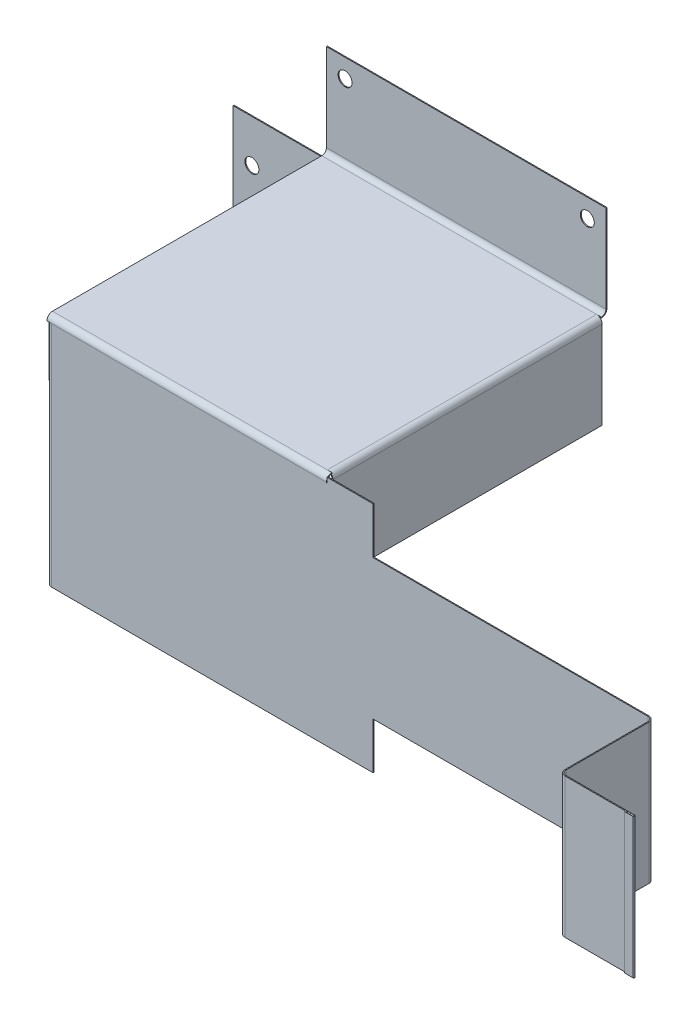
ISO-10303-21;
HEADER;
FILE_DESCRIPTION(('STEP AP214'),'2;1');
FILE_NAME('part.step','',(''),(''),'','','');
FILE_SCHEMA(('AUTOMOTIVE_DESIGN { 1 0 10303 214 1 1 1 1 }'));
ENDSEC;
DATA;
#1=APPLICATION_CONTEXT('core data for automotive mechanical design processes');
#2=APPLICATION_PROTOCOL_DEFINITION('international standard','automotive_design',2000,#1);
#3=PRODUCT_CONTEXT('',#1,'mechanical');
#4=PRODUCT('Part','Part','',(#3));
#5=PRODUCT_RELATED_PRODUCT_CATEGORY('part','',(#4));
#6=PRODUCT_DEFINITION_FORMATION('','',#4);
#7=PRODUCT_DEFINITION_CONTEXT('part definition',#1,'design');
#8=PRODUCT_DEFINITION('design','',#6,#7);
#9=PRODUCT_DEFINITION_SHAPE('','',#8);
#10=(LENGTH_UNIT() NAMED_UNIT(*) SI_UNIT(.MILLI.,.METRE.));
#11=(NAMED_UNIT(*) PLANE_ANGLE_UNIT() SI_UNIT($,.RADIAN.));
#12=(NAMED_UNIT(*) SI_UNIT($,.STERADIAN.) SOLID_ANGLE_UNIT());
#13=UNCERTAINTY_MEASURE_WITH_UNIT(LENGTH_MEASURE(1.E-05),#10,'distance_accuracy_value','');
#14=(GEOMETRIC_REPRESENTATION_CONTEXT(3) GLOBAL_UNCERTAINTY_ASSIGNED_CONTEXT((#13)) GLOBAL_UNIT_ASSIGNED_CONTEXT((#10,
#11,#12)) REPRESENTATION_CONTEXT('',''));
#15=CARTESIAN_POINT('',(0.,0.,0.));
#16=DIRECTION('',(0.,0.,1.));
#17=DIRECTION('',(1.,0.,0.));
#18=AXIS2_PLACEMENT_3D('',#15,#16,#17);
#19=CARTESIAN_POINT('',(125.,125.,-5.99999999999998));
#20=DIRECTION('',(0.,0.,-1.));
#21=DIRECTION('',(-1.,0.,0.));
#22=AXIS2_PLACEMENT_3D('',#19,#20,#21);
#23=PLANE('',#22);
#24=DIRECTION('',(-1.,0.,0.));
#25=VECTOR('',#24,1.);
#26=CARTESIAN_POINT('',(125.,125.,-5.99999999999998));
#27=LINE('',#26,#25);
#28=CARTESIAN_POINT('',(125.,125.,-5.99999999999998));
#29=VERTEX_POINT('',#28);
#30=CARTESIAN_POINT('',(123.316624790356,125.,-6.00000000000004));
#31=VERTEX_POINT('',#30);
#32=EDGE_CURVE('E475',#29,#31,#27,.T.);
#33=ORIENTED_EDGE('',*,*,#32,.T.);
#34=CARTESIAN_POINT('',(120.,120.,-6.00000000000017));
#35=DIRECTION('',(0.,0.,1.));
#36=DIRECTION('',(0.,-1.,0.));
#37=AXIS2_PLACEMENT_3D('',#34,#35,#36);
#38=CIRCLE('',#37,5.99999999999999);
#39=CARTESIAN_POINT('',(120.,126.,-6.00000000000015));
#40=VERTEX_POINT('',#39);
#41=EDGE_CURVE('E11',#31,#40,#38,.T.);
#42=ORIENTED_EDGE('',*,*,#41,.T.);
#43=DIRECTION('',(-1.,0.,0.));
#44=VECTOR('',#43,1.);
#45=CARTESIAN_POINT('',(125.,126.,-5.99999999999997));
#46=LINE('',#45,#44);
#47=CARTESIAN_POINT('',(125.,126.,-5.99999999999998));
#48=VERTEX_POINT('',#47);
#49=EDGE_CURVE('E687',#48,#40,#46,.T.);
#50=ORIENTED_EDGE('',*,*,#49,.F.);
#51=DIRECTION('',(0.,1.,0.));
#52=VECTOR('',#51,1.);
#53=CARTESIAN_POINT('',(125.,125.,-5.99999999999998));
#54=LINE('',#53,#52);
#55=EDGE_CURVE('E698',#29,#48,#54,.T.);
#56=ORIENTED_EDGE('',*,*,#55,.F.);
#57=EDGE_LOOP('',(#33,#42,#50,#56));
#58=FACE_BOUND('',#57,.T.);
#59=ADVANCED_FACE('F34',(#58),#23,.T.);
#60=CARTESIAN_POINT('',(120.,125.000000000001,-295.));
#61=DIRECTION('',(0.,0.,1.));
#62=DIRECTION('',(0.,-1.,0.));
#63=AXIS2_PLACEMENT_3D('',#60,#61,#62);
#64=PLANE('',#63);
#65=DIRECTION('',(-1.,0.,0.));
#66=VECTOR('',#65,1.);
#67=CARTESIAN_POINT('',(-175.,126.000000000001,-295.));
#68=LINE('',#67,#66);
#69=CARTESIAN_POINT('',(120.,126.000000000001,-295.));
#70=VERTEX_POINT('',#69);
#71=CARTESIAN_POINT('',(125.,126.000000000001,-295.));
#72=VERTEX_POINT('',#71);
#73=EDGE_CURVE('E711',#70,#72,#68,.F.);
#74=ORIENTED_EDGE('',*,*,#73,.F.);
#75=CARTESIAN_POINT('',(120.,120.000000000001,-295.));
#76=DIRECTION('',(0.,0.,1.));
#77=DIRECTION('',(0.,-1.,0.));
#78=AXIS2_PLACEMENT_3D('',#75,#76,#77);
#79=CIRCLE('',#78,5.99999999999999);
#80=CARTESIAN_POINT('',(123.316624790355,125.000000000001,-295.));
#81=VERTEX_POINT('',#80);
#82=EDGE_CURVE('E462',#70,#81,#79,.F.);
#83=ORIENTED_EDGE('',*,*,#82,.T.);
#84=DIRECTION('',(1.,0.,0.));
#85=VECTOR('',#84,1.);
#86=CARTESIAN_POINT('',(120.,125.000000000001,-295.));
#87=LINE('',#86,#85);
#88=CARTESIAN_POINT('',(125.,125.000000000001,-295.));
#89=VERTEX_POINT('',#88);
#90=EDGE_CURVE('E464',#81,#89,#87,.T.);
#91=ORIENTED_EDGE('',*,*,#90,.T.);
#92=DIRECTION('',(0.,-1.,0.));
#93=VECTOR('',#92,1.);
#94=CARTESIAN_POINT('',(125.,126.000000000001,-295.));
#95=LINE('',#94,#93);
#96=EDGE_CURVE('E697',#72,#89,#95,.T.);
#97=ORIENTED_EDGE('',*,*,#96,.F.);
#98=EDGE_LOOP('',(#74,#83,#91,#97));
#99=FACE_BOUND('',#98,.T.);
#100=ADVANCED_FACE('F923',(#99),#64,.T.);
#101=CARTESIAN_POINT('',(125.,126.,-0.999999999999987));
#102=DIRECTION('',(0.,-1.,0.));
#103=DIRECTION('',(0.,0.,-1.));
#104=AXIS2_PLACEMENT_3D('',#101,#102,#103);
#105=PLANE('',#104);
#106=DIRECTION('',(0.,0.,1.));
#107=VECTOR('',#106,1.);
#108=CARTESIAN_POINT('',(120.,126.,-5.99999999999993));
#109=LINE('',#108,#107);
#110=EDGE_CURVE('E458',#40,#70,#109,.F.);
#111=ORIENTED_EDGE('',*,*,#110,.T.);
#112=CARTESIAN_POINT('',(-175.,126.000000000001,-295.));
#113=VERTEX_POINT('',#112);
#114=EDGE_CURVE('E713',#113,#70,#68,.F.);
#115=ORIENTED_EDGE('',*,*,#114,.F.);
#116=DIRECTION('',(0.,0.,1.));
#117=VECTOR('',#116,1.);
#118=CARTESIAN_POINT('',(-175.,126.,-0.999999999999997));
#119=LINE('',#118,#117);
#120=CARTESIAN_POINT('',(-175.,126.,-5.99999999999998));
#121=VERTEX_POINT('',#120);
#122=EDGE_CURVE('E672',#113,#121,#119,.T.);
#123=ORIENTED_EDGE('',*,*,#122,.T.);
#124=EDGE_CURVE('E692',#40,#121,#46,.T.);
#125=ORIENTED_EDGE('',*,*,#124,.F.);
#126=EDGE_LOOP('',(#111,#115,#123,#125));
#127=FACE_BOUND('',#126,.T.);
#128=ADVANCED_FACE('F929',(#127),#105,.F.);
#129=CARTESIAN_POINT('',(125.,125.,-0.999999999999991));
#130=DIRECTION('',(0.,-1.,0.));
#131=DIRECTION('',(0.,0.,-1.));
#132=AXIS2_PLACEMENT_3D('',#129,#130,#131);
#133=PLANE('',#132);
#134=DIRECTION('',(-1.,0.,0.));
#135=VECTOR('',#134,1.);
#136=CARTESIAN_POINT('',(-175.,125.000000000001,-295.));
#137=LINE('',#136,#135);
#138=CARTESIAN_POINT('',(-175.,125.000000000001,-295.));
#139=VERTEX_POINT('',#138);
#140=CARTESIAN_POINT('',(120.,125.000000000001,-295.));
#141=VERTEX_POINT('',#140);
#142=EDGE_CURVE('E722',#139,#141,#137,.F.);
#143=ORIENTED_EDGE('',*,*,#142,.T.);
#144=DIRECTION('',(0.,0.,1.));
#145=VECTOR('',#144,1.);
#146=CARTESIAN_POINT('',(120.,125.,-5.99999999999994));
#147=LINE('',#146,#145);
#148=CARTESIAN_POINT('',(120.,125.,-6.00000000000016));
#149=VERTEX_POINT('',#148);
#150=EDGE_CURVE('E470',#149,#141,#147,.F.);
#151=ORIENTED_EDGE('',*,*,#150,.F.);
#152=DIRECTION('',(1.,0.,0.));
#153=VECTOR('',#152,1.);
#154=CARTESIAN_POINT('',(-175.,125.,-5.99999999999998));
#155=LINE('',#154,#153);
#156=CARTESIAN_POINT('',(-175.,125.,-5.99999999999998));
#157=VERTEX_POINT('',#156);
#158=EDGE_CURVE('E696',#157,#149,#155,.T.);
#159=ORIENTED_EDGE('',*,*,#158,.F.);
#160=DIRECTION('',(0.,0.,1.));
#161=VECTOR('',#160,1.);
#162=CARTESIAN_POINT('',(-175.,125.,-1.));
#163=LINE('',#162,#161);
#164=EDGE_CURVE('E685',#139,#157,#163,.T.);
#165=ORIENTED_EDGE('',*,*,#164,.F.);
#166=EDGE_LOOP('',(#143,#151,#159,#165));
#167=FACE_BOUND('',#166,.T.);
#168=ADVANCED_FACE('F978',(#167),#133,.T.);
#169=CARTESIAN_POINT('',(476.,-75.,99.));
#170=DIRECTION('',(0.,-1.,0.));
#171=DIRECTION('',(1.,0.,0.));
#172=AXIS2_PLACEMENT_3D('',#169,#170,#171);
#173=PLANE('',#172);
#174=DIRECTION('',(0.,0.,1.));
#175=VECTOR('',#174,1.);
#176=CARTESIAN_POINT('',(476.,-75.,99.));
#177=LINE('',#176,#175);
#178=CARTESIAN_POINT('',(476.,-75.,5.));
#179=VERTEX_POINT('',#178);
#180=CARTESIAN_POINT('',(476.,-75.,94.));
#181=VERTEX_POINT('',#180);
#182=EDGE_CURVE('E529',#179,#181,#177,.T.);
#183=ORIENTED_EDGE('',*,*,#182,.T.);
#184=DIRECTION('',(-1.,0.,0.));
#185=VECTOR('',#184,1.);
#186=CARTESIAN_POINT('',(476.,-74.9999999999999,94.));
#187=LINE('',#186,#185);
#188=CARTESIAN_POINT('',(475.,-74.9999999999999,94.));
#189=VERTEX_POINT('',#188);
#190=EDGE_CURVE('E503',#181,#189,#187,.T.);
#191=ORIENTED_EDGE('',*,*,#190,.T.);
#192=DIRECTION('',(0.,0.,1.));
#193=VECTOR('',#192,1.);
#194=CARTESIAN_POINT('',(475.,-75.,99.));
#195=LINE('',#194,#193);
#196=CARTESIAN_POINT('',(475.,-75.,5.));
#197=VERTEX_POINT('',#196);
#198=EDGE_CURVE('E528',#197,#189,#195,.T.);
#199=ORIENTED_EDGE('',*,*,#198,.F.);
#200=DIRECTION('',(1.,0.,0.));
#201=VECTOR('',#200,1.);
#202=CARTESIAN_POINT('',(475.,-75.,5.));
#203=LINE('',#202,#201);
#204=EDGE_CURVE('E515',#197,#179,#203,.T.);
#205=ORIENTED_EDGE('',*,*,#204,.T.);
#206=EDGE_LOOP('',(#183,#191,#199,#205));
#207=FACE_BOUND('',#206,.T.);
#208=ADVANCED_FACE('F968',(#207),#173,.T.);
#209=CARTESIAN_POINT('',(476.,75.,0.));
#210=DIRECTION('',(1.,0.,0.));
#211=DIRECTION('',(0.,0.,-1.));
#212=AXIS2_PLACEMENT_3D('',#209,#210,#211);
#213=PLANE('',#212);
#214=DIRECTION('',(0.,0.,-1.));
#215=VECTOR('',#214,1.);
#216=CARTESIAN_POINT('',(476.,75.,0.));
#217=LINE('',#216,#215);
#218=CARTESIAN_POINT('',(476.,75.,94.));
#219=VERTEX_POINT('',#218);
#220=CARTESIAN_POINT('',(476.,75.,4.99999999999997));
#221=VERTEX_POINT('',#220);
#222=EDGE_CURVE('E532',#219,#221,#217,.T.);
#223=ORIENTED_EDGE('',*,*,#222,.F.);
#224=DIRECTION('',(0.,-1.,0.));
#225=VECTOR('',#224,1.);
#226=CARTESIAN_POINT('',(476.,-75.,94.));
#227=LINE('',#226,#225);
#228=EDGE_CURVE('E509',#181,#219,#227,.F.);
#229=ORIENTED_EDGE('',*,*,#228,.F.);
#230=ORIENTED_EDGE('',*,*,#182,.F.);
#231=DIRECTION('',(0.,1.,0.));
#232=VECTOR('',#231,1.);
#233=CARTESIAN_POINT('',(476.,75.,4.99999999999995));
#234=LINE('',#233,#232);
#235=EDGE_CURVE('E523',#179,#221,#234,.T.);
#236=ORIENTED_EDGE('',*,*,#235,.T.);
#237=EDGE_LOOP('',(#223,#229,#230,#236));
#238=FACE_BOUND('',#237,.T.);
#239=ADVANCED_FACE('F964',(#238),#213,.T.);
#240=CARTESIAN_POINT('',(475.,75.,0.));
#241=DIRECTION('',(1.,0.,0.));
#242=DIRECTION('',(0.,0.,-1.));
#243=AXIS2_PLACEMENT_3D('',#240,#241,#242);
#244=PLANE('',#243);
#245=DIRECTION('',(0.,-1.,0.));
#246=VECTOR('',#245,1.);
#247=CARTESIAN_POINT('',(475.,-75.,94.));
#248=LINE('',#247,#246);
#249=CARTESIAN_POINT('',(475.,75.,94.));
#250=VERTEX_POINT('',#249);
#251=EDGE_CURVE('E497',#189,#250,#248,.F.);
#252=ORIENTED_EDGE('',*,*,#251,.T.);
#253=DIRECTION('',(0.,0.,-1.));
#254=VECTOR('',#253,1.);
#255=CARTESIAN_POINT('',(475.,75.,0.));
#256=LINE('',#255,#254);
#257=CARTESIAN_POINT('',(475.,75.,4.99999999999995));
#258=VERTEX_POINT('',#257);
#259=EDGE_CURVE('E533',#250,#258,#256,.T.);
#260=ORIENTED_EDGE('',*,*,#259,.T.);
#261=DIRECTION('',(0.,1.,0.));
#262=VECTOR('',#261,1.);
#263=CARTESIAN_POINT('',(475.,-75.,5.));
#264=LINE('',#263,#262);
#265=EDGE_CURVE('E517',#197,#258,#264,.T.);
#266=ORIENTED_EDGE('',*,*,#265,.F.);
#267=ORIENTED_EDGE('',*,*,#198,.T.);
#268=EDGE_LOOP('',(#252,#260,#266,#267));
#269=FACE_BOUND('',#268,.T.);
#270=ADVANCED_FACE('F967',(#269),#244,.F.);
#271=CARTESIAN_POINT('',(175.,125.,-1.));
#272=DIRECTION('',(0.,0.,-1.));
#273=DIRECTION('',(-1.,0.,0.));
#274=AXIS2_PLACEMENT_3D('',#271,#272,#273);
#275=PLANE('',#274);
#276=DIRECTION('',(-1.,0.,0.));
#277=VECTOR('',#276,1.);
#278=CARTESIAN_POINT('',(175.,74.9999999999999,-1.));
#279=LINE('',#278,#277);
#280=CARTESIAN_POINT('',(470.,75.,-1.00000000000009));
#281=VERTEX_POINT('',#280);
#282=CARTESIAN_POINT('',(175.,74.9999999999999,-1.));
#283=VERTEX_POINT('',#282);
#284=EDGE_CURVE('E38',#281,#283,#279,.T.);
#285=ORIENTED_EDGE('',*,*,#284,.F.);
#286=DIRECTION('',(0.,1.,0.));
#287=VECTOR('',#286,1.);
#288=CARTESIAN_POINT('',(470.,75.,-1.00000000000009));
#289=LINE('',#288,#287);
#290=CARTESIAN_POINT('',(470.,-75.,-1.));
#291=VERTEX_POINT('',#290);
#292=EDGE_CURVE('E539',#281,#291,#289,.F.);
#293=ORIENTED_EDGE('',*,*,#292,.T.);
#294=DIRECTION('',(1.,0.,0.));
#295=VECTOR('',#294,1.);
#296=CARTESIAN_POINT('',(175.,-75.,-1.));
#297=LINE('',#296,#295);
#298=CARTESIAN_POINT('',(175.,-75.,-1.));
#299=VERTEX_POINT('',#298);
#300=EDGE_CURVE('E578',#299,#291,#297,.T.);
#301=ORIENTED_EDGE('',*,*,#300,.F.);
#302=DIRECTION('',(0.,1.,0.));
#303=VECTOR('',#302,1.);
#304=CARTESIAN_POINT('',(175.,-125.,-1.));
#305=LINE('',#304,#303);
#306=CARTESIAN_POINT('',(175.,-125.,-1.));
#307=VERTEX_POINT('',#306);
#308=EDGE_CURVE('E612',#307,#299,#305,.T.);
#309=ORIENTED_EDGE('',*,*,#308,.F.);
#310=DIRECTION('',(1.,0.,0.));
#311=VECTOR('',#310,1.);
#312=CARTESIAN_POINT('',(-175.,-125.,-1.));
#313=LINE('',#312,#311);
#314=CARTESIAN_POINT('',(-170.,-125.,-0.999999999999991));
#315=VERTEX_POINT('',#314);
#316=EDGE_CURVE('E628',#315,#307,#313,.T.);
#317=ORIENTED_EDGE('',*,*,#316,.F.);
#318=DIRECTION('',(0.,1.,0.));
#319=VECTOR('',#318,1.);
#320=CARTESIAN_POINT('',(-170.,120.,-0.999999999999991));
#321=LINE('',#320,#319);
#322=CARTESIAN_POINT('',(-170.,120.,-0.999999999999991));
#323=VERTEX_POINT('',#322);
#324=EDGE_CURVE('E782',#323,#315,#321,.F.);
#325=ORIENTED_EDGE('',*,*,#324,.F.);
#326=DIRECTION('',(1.,0.,0.));
#327=VECTOR('',#326,1.);
#328=CARTESIAN_POINT('',(125.,120.,-0.999999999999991));
#329=LINE('',#328,#327);
#330=CARTESIAN_POINT('',(125.,120.,-1.));
#331=VERTEX_POINT('',#330);
#332=EDGE_CURVE('E671',#331,#323,#329,.F.);
#333=ORIENTED_EDGE('',*,*,#332,.F.);
#334=DIRECTION('',(0.,1.,0.));
#335=VECTOR('',#334,1.);
#336=CARTESIAN_POINT('',(125.,119.5,-0.999999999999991));
#337=LINE('',#336,#335);
#338=CARTESIAN_POINT('',(125.,119.5,-1.));
#339=VERTEX_POINT('',#338);
#340=EDGE_CURVE('E652',#339,#331,#337,.T.);
#341=ORIENTED_EDGE('',*,*,#340,.F.);
#342=DIRECTION('',(-1.,0.,0.));
#343=VECTOR('',#342,1.);
#344=CARTESIAN_POINT('',(125.5,119.5,-0.999999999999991));
#345=LINE('',#344,#343);
#346=CARTESIAN_POINT('',(125.5,119.5,-1.));
#347=VERTEX_POINT('',#346);
#348=EDGE_CURVE('E648',#347,#339,#345,.T.);
#349=ORIENTED_EDGE('',*,*,#348,.F.);
#350=DIRECTION('',(0.,-1.,0.));
#351=VECTOR('',#350,1.);
#352=CARTESIAN_POINT('',(125.5,125.,-0.999999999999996));
#353=LINE('',#352,#351);
#354=CARTESIAN_POINT('',(125.5,125.,-1.));
#355=VERTEX_POINT('',#354);
#356=EDGE_CURVE('E647',#355,#347,#353,.T.);
#357=ORIENTED_EDGE('',*,*,#356,.F.);
#358=DIRECTION('',(-1.,0.,0.));
#359=VECTOR('',#358,1.);
#360=CARTESIAN_POINT('',(-175.,125.,-1.));
#361=LINE('',#360,#359);
#362=CARTESIAN_POINT('',(175.,125.,-1.));
#363=VERTEX_POINT('',#362);
#364=EDGE_CURVE('E611',#363,#355,#361,.T.);
#365=ORIENTED_EDGE('',*,*,#364,.F.);
#366=EDGE_CURVE('E588',#283,#363,#305,.T.);
#367=ORIENTED_EDGE('',*,*,#366,.F.);
#368=EDGE_LOOP('',(#285,#293,#301,#309,#317,#325,#333,#341,#349,#357,#365,#367));
#369=FACE_BOUND('',#368,.T.);
#370=ADVANCED_FACE('F609',(#369),#275,.T.);
#371=CARTESIAN_POINT('',(175.,125.,0.));
#372=DIRECTION('',(0.,0.,-1.));
#373=DIRECTION('',(-1.,0.,0.));
#374=AXIS2_PLACEMENT_3D('',#371,#372,#373);
#375=PLANE('',#374);
#376=DIRECTION('',(0.,1.,0.));
#377=VECTOR('',#376,1.);
#378=CARTESIAN_POINT('',(470.,75.,0.));
#379=LINE('',#378,#377);
#380=CARTESIAN_POINT('',(470.,75.,0.));
#381=VERTEX_POINT('',#380);
#382=CARTESIAN_POINT('',(470.,-75.,0.));
#383=VERTEX_POINT('',#382);
#384=EDGE_CURVE('E552',#381,#383,#379,.F.);
#385=ORIENTED_EDGE('',*,*,#384,.F.);
#386=DIRECTION('',(-1.,0.,0.));
#387=VECTOR('',#386,1.);
#388=CARTESIAN_POINT('',(175.,74.9999999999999,0.));
#389=LINE('',#388,#387);
#390=CARTESIAN_POINT('',(175.,74.9999999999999,0.));
#391=VERTEX_POINT('',#390);
#392=EDGE_CURVE('E577',#381,#391,#389,.T.);
#393=ORIENTED_EDGE('',*,*,#392,.T.);
#394=DIRECTION('',(0.,1.,0.));
#395=VECTOR('',#394,1.);
#396=CARTESIAN_POINT('',(175.,-125.,0.));
#397=LINE('',#396,#395);
#398=CARTESIAN_POINT('',(175.,125.,0.));
#399=VERTEX_POINT('',#398);
#400=EDGE_CURVE('E607',#391,#399,#397,.T.);
#401=ORIENTED_EDGE('',*,*,#400,.T.);
#402=DIRECTION('',(-1.,0.,0.));
#403=VECTOR('',#402,1.);
#404=CARTESIAN_POINT('',(-175.,125.,0.));
#405=LINE('',#404,#403);
#406=CARTESIAN_POINT('',(125.5,125.,0.));
#407=VERTEX_POINT('',#406);
#408=EDGE_CURVE('E614',#399,#407,#405,.T.);
#409=ORIENTED_EDGE('',*,*,#408,.T.);
#410=DIRECTION('',(0.,1.,0.));
#411=VECTOR('',#410,1.);
#412=CARTESIAN_POINT('',(125.5,125.,0.));
#413=LINE('',#412,#411);
#414=CARTESIAN_POINT('',(125.5,119.5,0.));
#415=VERTEX_POINT('',#414);
#416=EDGE_CURVE('E634',#415,#407,#413,.T.);
#417=ORIENTED_EDGE('',*,*,#416,.F.);
#418=DIRECTION('',(1.,0.,0.));
#419=VECTOR('',#418,1.);
#420=CARTESIAN_POINT('',(175.,119.5,0.));
#421=LINE('',#420,#419);
#422=CARTESIAN_POINT('',(125.,119.5,0.));
#423=VERTEX_POINT('',#422);
#424=EDGE_CURVE('E631',#423,#415,#421,.T.);
#425=ORIENTED_EDGE('',*,*,#424,.F.);
#426=DIRECTION('',(0.,-1.,0.));
#427=VECTOR('',#426,1.);
#428=CARTESIAN_POINT('',(125.,125.,0.));
#429=LINE('',#428,#427);
#430=CARTESIAN_POINT('',(125.,120.,0.));
#431=VERTEX_POINT('',#430);
#432=EDGE_CURVE('E625',#431,#423,#429,.T.);
#433=ORIENTED_EDGE('',*,*,#432,.F.);
#434=DIRECTION('',(1.,0.,0.));
#435=VECTOR('',#434,1.);
#436=CARTESIAN_POINT('',(125.,120.,0.));
#437=LINE('',#436,#435);
#438=CARTESIAN_POINT('',(-170.,120.,0.));
#439=VERTEX_POINT('',#438);
#440=EDGE_CURVE('E680',#431,#439,#437,.F.);
#441=ORIENTED_EDGE('',*,*,#440,.T.);
#442=DIRECTION('',(0.,1.,0.));
#443=VECTOR('',#442,1.);
#444=CARTESIAN_POINT('',(-170.,120.,0.));
#445=LINE('',#444,#443);
#446=CARTESIAN_POINT('',(-170.,-125.,0.));
#447=VERTEX_POINT('',#446);
#448=EDGE_CURVE('E792',#439,#447,#445,.F.);
#449=ORIENTED_EDGE('',*,*,#448,.T.);
#450=DIRECTION('',(1.,0.,0.));
#451=VECTOR('',#450,1.);
#452=CARTESIAN_POINT('',(-175.,-125.,0.));
#453=LINE('',#452,#451);
#454=CARTESIAN_POINT('',(175.,-125.,0.));
#455=VERTEX_POINT('',#454);
#456=EDGE_CURVE('E613',#447,#455,#453,.T.);
#457=ORIENTED_EDGE('',*,*,#456,.T.);
#458=CARTESIAN_POINT('',(175.,-75.,0.));
#459=VERTEX_POINT('',#458);
#460=EDGE_CURVE('E619',#455,#459,#397,.T.);
#461=ORIENTED_EDGE('',*,*,#460,.T.);
#462=DIRECTION('',(1.,0.,0.));
#463=VECTOR('',#462,1.);
#464=CARTESIAN_POINT('',(175.,-75.,0.));
#465=LINE('',#464,#463);
#466=EDGE_CURVE('E559',#459,#383,#465,.T.);
#467=ORIENTED_EDGE('',*,*,#466,.T.);
#468=EDGE_LOOP('',(#385,#393,#401,#409,#417,#425,#433,#441,#449,#457,#461,#467));
#469=FACE_BOUND('',#468,.T.);
#470=ADVANCED_FACE('F999',(#469),#375,.F.);
#471=CARTESIAN_POINT('',(175.,74.9999999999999,-1.));
#472=DIRECTION('',(0.,1.,0.));
#473=DIRECTION('',(-1.,0.,0.));
#474=AXIS2_PLACEMENT_3D('',#471,#472,#473);
#475=PLANE('',#474);
#476=ORIENTED_EDGE('',*,*,#392,.F.);
#477=DIRECTION('',(0.,0.,-1.));
#478=VECTOR('',#477,1.);
#479=CARTESIAN_POINT('',(470.,75.,0.));
#480=LINE('',#479,#478);
#481=EDGE_CURVE('E546',#381,#281,#480,.T.);
#482=ORIENTED_EDGE('',*,*,#481,.T.);
#483=ORIENTED_EDGE('',*,*,#284,.T.);
#484=DIRECTION('',(0.,0.,1.));
#485=VECTOR('',#484,1.);
#486=CARTESIAN_POINT('',(175.,74.9999999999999,-1.));
#487=LINE('',#486,#485);
#488=EDGE_CURVE('E567',#283,#391,#487,.T.);
#489=ORIENTED_EDGE('',*,*,#488,.T.);
#490=EDGE_LOOP('',(#476,#482,#483,#489));
#491=FACE_BOUND('',#490,.T.);
#492=ADVANCED_FACE('F600',(#491),#475,.T.);
#493=CARTESIAN_POINT('',(175.,-125.,-1.));
#494=DIRECTION('',(1.,0.,0.));
#495=DIRECTION('',(0.,0.,-1.));
#496=AXIS2_PLACEMENT_3D('',#493,#494,#495);
#497=PLANE('',#496);
#498=ORIENTED_EDGE('',*,*,#308,.T.);
#499=DIRECTION('',(0.,0.,1.));
#500=VECTOR('',#499,1.);
#501=CARTESIAN_POINT('',(175.,-75.,-1.));
#502=LINE('',#501,#500);
#503=EDGE_CURVE('E571',#299,#459,#502,.T.);
#504=ORIENTED_EDGE('',*,*,#503,.T.);
#505=ORIENTED_EDGE('',*,*,#460,.F.);
#506=DIRECTION('',(0.,0.,1.));
#507=VECTOR('',#506,1.);
#508=CARTESIAN_POINT('',(175.,-125.,-1.));
#509=LINE('',#508,#507);
#510=EDGE_CURVE('E623',#307,#455,#509,.T.);
#511=ORIENTED_EDGE('',*,*,#510,.F.);
#512=EDGE_LOOP('',(#498,#504,#505,#511));
#513=FACE_BOUND('',#512,.T.);
#514=ADVANCED_FACE('F998',(#513),#497,.T.);
#515=CARTESIAN_POINT('',(-176.000000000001,-125.,-300.));
#516=DIRECTION('',(0.,-1.,0.));
#517=DIRECTION('',(0.,0.,-1.));
#518=AXIS2_PLACEMENT_3D('',#515,#516,#517);
#519=PLANE('',#518);
#520=DIRECTION('',(0.,0.,-1.));
#521=VECTOR('',#520,1.);
#522=CARTESIAN_POINT('',(-176.000000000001,-125.,-300.));
#523=LINE('',#522,#521);
#524=CARTESIAN_POINT('',(-176.,-125.,-5.99999999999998));
#525=VERTEX_POINT('',#524);
#526=CARTESIAN_POINT('',(-176.000000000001,-125.,-295.));
#527=VERTEX_POINT('',#526);
#528=EDGE_CURVE('E798',#525,#527,#523,.T.);
#529=ORIENTED_EDGE('',*,*,#528,.T.);
#530=DIRECTION('',(1.,0.,0.));
#531=VECTOR('',#530,1.);
#532=CARTESIAN_POINT('',(-176.000000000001,-125.,-295.));
#533=LINE('',#532,#531);
#534=CARTESIAN_POINT('',(-175.000000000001,-125.,-295.));
#535=VERTEX_POINT('',#534);
#536=EDGE_CURVE('E818',#527,#535,#533,.T.);
#537=ORIENTED_EDGE('',*,*,#536,.T.);
#538=DIRECTION('',(0.,0.,-1.));
#539=VECTOR('',#538,1.);
#540=CARTESIAN_POINT('',(-175.000000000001,-125.,-300.));
#541=LINE('',#540,#539);
#542=CARTESIAN_POINT('',(-175.,-125.,-5.99999999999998));
#543=VERTEX_POINT('',#542);
#544=EDGE_CURVE('E799',#543,#535,#541,.T.);
#545=ORIENTED_EDGE('',*,*,#544,.F.);
#546=DIRECTION('',(-1.,0.,0.));
#547=VECTOR('',#546,1.);
#548=CARTESIAN_POINT('',(-175.,-125.,-5.99999999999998));
#549=LINE('',#548,#547);
#550=EDGE_CURVE('E809',#543,#525,#549,.T.);
#551=ORIENTED_EDGE('',*,*,#550,.T.);
#552=EDGE_LOOP('',(#529,#537,#545,#551));
#553=FACE_BOUND('',#552,.T.);
#554=ADVANCED_FACE('F1065',(#553),#519,.T.);
#555=CARTESIAN_POINT('',(-176.,120.,-0.999999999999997));
#556=DIRECTION('',(-1.,0.,0.));
#557=DIRECTION('',(0.,0.,1.));
#558=AXIS2_PLACEMENT_3D('',#555,#556,#557);
#559=PLANE('',#558);
#560=DIRECTION('',(0.,0.,1.));
#561=VECTOR('',#560,1.);
#562=CARTESIAN_POINT('',(-176.,120.,-0.999999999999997));
#563=LINE('',#562,#561);
#564=CARTESIAN_POINT('',(-176.000000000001,120.,-295.));
#565=VERTEX_POINT('',#564);
#566=CARTESIAN_POINT('',(-176.,120.,-5.99999999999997));
#567=VERTEX_POINT('',#566);
#568=EDGE_CURVE('E783',#565,#567,#563,.T.);
#569=ORIENTED_EDGE('',*,*,#568,.F.);
#570=DIRECTION('',(0.,-1.,0.));
#571=VECTOR('',#570,1.);
#572=CARTESIAN_POINT('',(-176.000000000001,-125.,-295.));
#573=LINE('',#572,#571);
#574=EDGE_CURVE('E826',#527,#565,#573,.F.);
#575=ORIENTED_EDGE('',*,*,#574,.F.);
#576=ORIENTED_EDGE('',*,*,#528,.F.);
#577=DIRECTION('',(0.,1.,0.));
#578=VECTOR('',#577,1.);
#579=CARTESIAN_POINT('',(-176.,120.,-5.99999999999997));
#580=LINE('',#579,#578);
#581=EDGE_CURVE('E802',#525,#567,#580,.T.);
#582=ORIENTED_EDGE('',*,*,#581,.T.);
#583=EDGE_LOOP('',(#569,#575,#576,#582));
#584=FACE_BOUND('',#583,.T.);
#585=ADVANCED_FACE('F1586',(#584),#559,.T.);
#586=CARTESIAN_POINT('',(-175.,120.,-1.));
#587=DIRECTION('',(-1.,0.,0.));
#588=DIRECTION('',(0.,0.,1.));
#589=AXIS2_PLACEMENT_3D('',#586,#587,#588);
#590=PLANE('',#589);
#591=DIRECTION('',(0.,-1.,0.));
#592=VECTOR('',#591,1.);
#593=CARTESIAN_POINT('',(-175.000000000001,-125.,-295.));
#594=LINE('',#593,#592);
#595=CARTESIAN_POINT('',(-175.000000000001,120.,-295.));
#596=VERTEX_POINT('',#595);
#597=EDGE_CURVE('E836',#535,#596,#594,.F.);
#598=ORIENTED_EDGE('',*,*,#597,.T.);
#599=DIRECTION('',(0.,0.,1.));
#600=VECTOR('',#599,1.);
#601=CARTESIAN_POINT('',(-175.,120.,-1.));
#602=LINE('',#601,#600);
#603=CARTESIAN_POINT('',(-175.,120.,-5.99999999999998));
#604=VERTEX_POINT('',#603);
#605=EDGE_CURVE('E796',#596,#604,#602,.T.);
#606=ORIENTED_EDGE('',*,*,#605,.T.);
#607=DIRECTION('',(0.,1.,0.));
#608=VECTOR('',#607,1.);
#609=CARTESIAN_POINT('',(-175.,-125.,-5.99999999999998));
#610=LINE('',#609,#608);
#611=EDGE_CURVE('E812',#543,#604,#610,.T.);
#612=ORIENTED_EDGE('',*,*,#611,.F.);
#613=ORIENTED_EDGE('',*,*,#544,.T.);
#614=EDGE_LOOP('',(#598,#606,#612,#613));
#615=FACE_BOUND('',#614,.T.);
#616=ADVANCED_FACE('F1687',(#615),#590,.F.);
#617=CARTESIAN_POINT('',(-175.,120.,-1.));
#618=DIRECTION('',(0.,-1.,0.));
#619=DIRECTION('',(0.,0.,-1.));
#620=AXIS2_PLACEMENT_3D('',#617,#618,#619);
#621=PLANE('',#620);
#622=DIRECTION('',(1.,0.,0.));
#623=VECTOR('',#622,1.);
#624=CARTESIAN_POINT('',(-175.,120.,-1.));
#625=LINE('',#624,#623);
#626=CARTESIAN_POINT('',(-175.,120.,-1.));
#627=VERTEX_POINT('',#626);
#628=CARTESIAN_POINT('',(-173.316624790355,120.,-0.999999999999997));
#629=VERTEX_POINT('',#628);
#630=EDGE_CURVE('E771',#627,#629,#625,.T.);
#631=ORIENTED_EDGE('',*,*,#630,.T.);
#632=CARTESIAN_POINT('',(-170.,120.,-6.));
#633=DIRECTION('',(0.,1.,0.));
#634=DIRECTION('',(0.,0.,1.));
#635=AXIS2_PLACEMENT_3D('',#632,#633,#634);
#636=CIRCLE('',#635,6.);
#637=EDGE_CURVE('E44',#629,#439,#636,.T.);
#638=ORIENTED_EDGE('',*,*,#637,.T.);
#639=DIRECTION('',(1.,0.,0.));
#640=VECTOR('',#639,1.);
#641=CARTESIAN_POINT('',(125.,120.,0.));
#642=LINE('',#641,#640);
#643=CARTESIAN_POINT('',(-175.,120.,0.));
#644=VERTEX_POINT('',#643);
#645=EDGE_CURVE('E765',#644,#439,#642,.T.);
#646=ORIENTED_EDGE('',*,*,#645,.F.);
#647=DIRECTION('',(0.,0.,1.));
#648=VECTOR('',#647,1.);
#649=CARTESIAN_POINT('',(-175.,120.,-0.999999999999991));
#650=LINE('',#649,#648);
#651=EDGE_CURVE('E656',#627,#644,#650,.T.);
#652=ORIENTED_EDGE('',*,*,#651,.F.);
#653=EDGE_LOOP('',(#631,#638,#646,#652));
#654=FACE_BOUND('',#653,.T.);
#655=ADVANCED_FACE('F1601',(#654),#621,.T.);
#656=CARTESIAN_POINT('',(-175.,126.,-0.999999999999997));
#657=DIRECTION('',(1.,0.,0.));
#658=DIRECTION('',(0.,0.,-1.));
#659=AXIS2_PLACEMENT_3D('',#656,#657,#658);
#660=PLANE('',#659);
#661=DIRECTION('',(0.,-1.,0.));
#662=VECTOR('',#661,1.);
#663=CARTESIAN_POINT('',(-175.,126.000000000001,-295.));
#664=LINE('',#663,#662);
#665=EDGE_CURVE('E702',#113,#139,#664,.T.);
#666=ORIENTED_EDGE('',*,*,#665,.T.);
#667=ORIENTED_EDGE('',*,*,#164,.T.);
#668=DIRECTION('',(0.,1.,0.));
#669=VECTOR('',#668,1.);
#670=CARTESIAN_POINT('',(-175.,125.,-5.99999999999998));
#671=LINE('',#670,#669);
#672=EDGE_CURVE('E693',#157,#121,#671,.T.);
#673=ORIENTED_EDGE('',*,*,#672,.T.);
#674=ORIENTED_EDGE('',*,*,#122,.F.);
#675=EDGE_LOOP('',(#666,#667,#673,#674));
#676=FACE_BOUND('',#675,.T.);
#677=ADVANCED_FACE('F1612',(#676),#660,.F.);
#678=CARTESIAN_POINT('',(-175.,125.,-1.));
#679=DIRECTION('',(0.,1.,0.));
#680=DIRECTION('',(0.,0.,1.));
#681=AXIS2_PLACEMENT_3D('',#678,#679,#680);
#682=PLANE('',#681);
#683=ORIENTED_EDGE('',*,*,#364,.T.);
#684=DIRECTION('',(0.,0.,1.));
#685=VECTOR('',#684,1.);
#686=CARTESIAN_POINT('',(125.5,125.,-0.999999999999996));
#687=LINE('',#686,#685);
#688=EDGE_CURVE('E644',#355,#407,#687,.T.);
#689=ORIENTED_EDGE('',*,*,#688,.T.);
#690=ORIENTED_EDGE('',*,*,#408,.F.);
#691=DIRECTION('',(0.,0.,1.));
#692=VECTOR('',#691,1.);
#693=CARTESIAN_POINT('',(175.,125.,-1.));
#694=LINE('',#693,#692);
#695=EDGE_CURVE('E626',#363,#399,#694,.T.);
#696=ORIENTED_EDGE('',*,*,#695,.F.);
#697=EDGE_LOOP('',(#683,#689,#690,#696));
#698=FACE_BOUND('',#697,.T.);
#699=ADVANCED_FACE('F1075',(#698),#682,.T.);
#700=ORIENTED_EDGE('',*,*,#488,.F.);
#701=ORIENTED_EDGE('',*,*,#366,.T.);
#702=ORIENTED_EDGE('',*,*,#695,.T.);
#703=ORIENTED_EDGE('',*,*,#400,.F.);
#704=EDGE_LOOP('',(#700,#701,#702,#703));
#705=FACE_BOUND('',#704,.T.);
#706=ADVANCED_FACE('F36',(#705),#497,.T.);
#707=CARTESIAN_POINT('',(-175.,-125.,-1.));
#708=DIRECTION('',(0.,-1.,0.));
#709=DIRECTION('',(0.,0.,-1.));
#710=AXIS2_PLACEMENT_3D('',#707,#708,#709);
#711=PLANE('',#710);
#712=DIRECTION('',(0.,0.,1.));
#713=VECTOR('',#712,1.);
#714=CARTESIAN_POINT('',(-170.,-125.,-0.999999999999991));
#715=LINE('',#714,#713);
#716=EDGE_CURVE('E775',#315,#447,#715,.T.);
#717=ORIENTED_EDGE('',*,*,#716,.F.);
#718=ORIENTED_EDGE('',*,*,#316,.T.);
#719=ORIENTED_EDGE('',*,*,#510,.T.);
#720=ORIENTED_EDGE('',*,*,#456,.F.);
#721=EDGE_LOOP('',(#717,#718,#719,#720));
#722=FACE_BOUND('',#721,.T.);
#723=ADVANCED_FACE('F1074',(#722),#711,.T.);
#724=CARTESIAN_POINT('',(125.5,125.,-0.999999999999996));
#725=DIRECTION('',(-1.,0.,0.));
#726=DIRECTION('',(0.,-1.,0.));
#727=AXIS2_PLACEMENT_3D('',#724,#725,#726);
#728=PLANE('',#727);
#729=DIRECTION('',(0.,0.,1.));
#730=VECTOR('',#729,1.);
#731=CARTESIAN_POINT('',(125.5,119.5,-0.999999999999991));
#732=LINE('',#731,#730);
#733=EDGE_CURVE('E649',#347,#415,#732,.T.);
#734=ORIENTED_EDGE('',*,*,#733,.T.);
#735=ORIENTED_EDGE('',*,*,#416,.T.);
#736=ORIENTED_EDGE('',*,*,#688,.F.);
#737=ORIENTED_EDGE('',*,*,#356,.T.);
#738=EDGE_LOOP('',(#734,#735,#736,#737));
#739=FACE_BOUND('',#738,.T.);
#740=ADVANCED_FACE('F1640',(#739),#728,.T.);
#741=CARTESIAN_POINT('',(125.5,119.5,-0.999999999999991));
#742=DIRECTION('',(0.,1.,0.));
#743=DIRECTION('',(0.,0.,1.));
#744=AXIS2_PLACEMENT_3D('',#741,#742,#743);
#745=PLANE('',#744);
#746=DIRECTION('',(0.,0.,1.));
#747=VECTOR('',#746,1.);
#748=CARTESIAN_POINT('',(125.,119.5,-0.999999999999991));
#749=LINE('',#748,#747);
#750=EDGE_CURVE('E653',#339,#423,#749,.T.);
#751=ORIENTED_EDGE('',*,*,#750,.T.);
#752=ORIENTED_EDGE('',*,*,#424,.T.);
#753=ORIENTED_EDGE('',*,*,#733,.F.);
#754=ORIENTED_EDGE('',*,*,#348,.T.);
#755=EDGE_LOOP('',(#751,#752,#753,#754));
#756=FACE_BOUND('',#755,.T.);
#757=ADVANCED_FACE('F1638',(#756),#745,.T.);
#758=CARTESIAN_POINT('',(125.,119.5,-0.999999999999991));
#759=DIRECTION('',(1.,0.,0.));
#760=DIRECTION('',(0.,0.,-1.));
#761=AXIS2_PLACEMENT_3D('',#758,#759,#760);
#762=PLANE('',#761);
#763=DIRECTION('',(0.,0.,1.));
#764=VECTOR('',#763,1.);
#765=CARTESIAN_POINT('',(125.,120.,-0.999999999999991));
#766=LINE('',#765,#764);
#767=EDGE_CURVE('E663',#331,#431,#766,.T.);
#768=ORIENTED_EDGE('',*,*,#767,.T.);
#769=ORIENTED_EDGE('',*,*,#432,.T.);
#770=ORIENTED_EDGE('',*,*,#750,.F.);
#771=ORIENTED_EDGE('',*,*,#340,.T.);
#772=EDGE_LOOP('',(#768,#769,#770,#771));
#773=FACE_BOUND('',#772,.T.);
#774=ADVANCED_FACE('F1634',(#773),#762,.T.);
#775=CARTESIAN_POINT('',(-175.,120.,-6.));
#776=DIRECTION('',(-1.,0.,0.));
#777=DIRECTION('',(0.,0.,1.));
#778=AXIS2_PLACEMENT_3D('',#775,#776,#777);
#779=PLANE('',#778);
#780=ORIENTED_EDGE('',*,*,#672,.F.);
#781=CARTESIAN_POINT('',(-175.,120.,-6.));
#782=DIRECTION('',(1.,0.,0.));
#783=DIRECTION('',(0.,0.,-1.));
#784=AXIS2_PLACEMENT_3D('',#781,#782,#783);
#785=CIRCLE('',#784,5.);
#786=EDGE_CURVE('E674',#627,#157,#785,.F.);
#787=ORIENTED_EDGE('',*,*,#786,.F.);
#788=ORIENTED_EDGE('',*,*,#651,.T.);
#789=CARTESIAN_POINT('',(-175.,120.,-6.));
#790=DIRECTION('',(1.,0.,0.));
#791=DIRECTION('',(0.,0.,-1.));
#792=AXIS2_PLACEMENT_3D('',#789,#790,#791);
#793=CIRCLE('',#792,6.);
#794=EDGE_CURVE('E665',#644,#121,#793,.F.);
#795=ORIENTED_EDGE('',*,*,#794,.T.);
#796=EDGE_LOOP('',(#780,#787,#788,#795));
#797=FACE_BOUND('',#796,.T.);
#798=ADVANCED_FACE('F1234',(#797),#779,.T.);
#799=CARTESIAN_POINT('',(125.,120.,-6.));
#800=DIRECTION('',(-1.,0.,0.));
#801=DIRECTION('',(0.,0.,1.));
#802=AXIS2_PLACEMENT_3D('',#799,#800,#801);
#803=PLANE('',#802);
#804=CARTESIAN_POINT('',(125.,120.,-6.));
#805=DIRECTION('',(1.,0.,0.));
#806=DIRECTION('',(0.,0.,-1.));
#807=AXIS2_PLACEMENT_3D('',#804,#805,#806);
#808=CIRCLE('',#807,5.);
#809=EDGE_CURVE('E668',#29,#331,#808,.T.);
#810=ORIENTED_EDGE('',*,*,#809,.F.);
#811=ORIENTED_EDGE('',*,*,#55,.T.);
#812=CARTESIAN_POINT('',(125.,120.,-6.));
#813=DIRECTION('',(1.,0.,0.));
#814=DIRECTION('',(0.,0.,-1.));
#815=AXIS2_PLACEMENT_3D('',#812,#813,#814);
#816=CIRCLE('',#815,6.);
#817=EDGE_CURVE('E677',#48,#431,#816,.T.);
#818=ORIENTED_EDGE('',*,*,#817,.T.);
#819=ORIENTED_EDGE('',*,*,#767,.F.);
#820=EDGE_LOOP('',(#810,#811,#818,#819));
#821=FACE_BOUND('',#820,.T.);
#822=ADVANCED_FACE('F1228',(#821),#803,.F.);
#823=CARTESIAN_POINT('',(125.,120.,-6.));
#824=DIRECTION('',(1.,0.,0.));
#825=DIRECTION('',(0.,1.,0.));
#826=AXIS2_PLACEMENT_3D('',#823,#824,#825);
#827=CYLINDRICAL_SURFACE('',#826,6.);
#828=ORIENTED_EDGE('',*,*,#440,.F.);
#829=ORIENTED_EDGE('',*,*,#817,.F.);
#830=ORIENTED_EDGE('',*,*,#49,.T.);
#831=ORIENTED_EDGE('',*,*,#124,.T.);
#832=ORIENTED_EDGE('',*,*,#794,.F.);
#833=ORIENTED_EDGE('',*,*,#645,.T.);
#834=EDGE_LOOP('',(#828,#829,#830,#831,#832,#833));
#835=FACE_BOUND('',#834,.T.);
#836=ADVANCED_FACE('F1233',(#835),#827,.T.);
#837=CARTESIAN_POINT('',(125.,120.,-6.));
#838=DIRECTION('',(1.,0.,0.));
#839=DIRECTION('',(0.,1.,0.));
#840=AXIS2_PLACEMENT_3D('',#837,#838,#839);
#841=CYLINDRICAL_SURFACE('',#840,5.);
#842=ORIENTED_EDGE('',*,*,#332,.T.);
#843=EDGE_CURVE('E774',#629,#323,#625,.T.);
#844=ORIENTED_EDGE('',*,*,#843,.F.);
#845=ORIENTED_EDGE('',*,*,#630,.F.);
#846=ORIENTED_EDGE('',*,*,#786,.T.);
#847=ORIENTED_EDGE('',*,*,#158,.T.);
#848=EDGE_CURVE('E53',#31,#149,#27,.T.);
#849=ORIENTED_EDGE('',*,*,#848,.F.);
#850=ORIENTED_EDGE('',*,*,#32,.F.);
#851=ORIENTED_EDGE('',*,*,#809,.T.);
#852=EDGE_LOOP('',(#842,#844,#845,#846,#847,#849,#850,#851));
#853=FACE_BOUND('',#852,.T.);
#854=ADVANCED_FACE('F1247',(#853),#841,.F.);
#855=CARTESIAN_POINT('',(125.,131.000000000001,-295.));
#856=DIRECTION('',(1.,0.,0.));
#857=DIRECTION('',(0.,0.,-1.));
#858=AXIS2_PLACEMENT_3D('',#855,#856,#857);
#859=PLANE('',#858);
#860=DIRECTION('',(0.,0.,-1.));
#861=VECTOR('',#860,1.);
#862=CARTESIAN_POINT('',(125.,131.000000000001,-300.));
#863=LINE('',#862,#861);
#864=CARTESIAN_POINT('',(125.,131.000000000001,-300.));
#865=VERTEX_POINT('',#864);
#866=CARTESIAN_POINT('',(125.,131.000000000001,-301.));
#867=VERTEX_POINT('',#866);
#868=EDGE_CURVE('E761',#865,#867,#863,.T.);
#869=ORIENTED_EDGE('',*,*,#868,.F.);
#870=CARTESIAN_POINT('',(125.,131.000000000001,-295.));
#871=DIRECTION('',(-1.,0.,0.));
#872=DIRECTION('',(0.,0.,1.));
#873=AXIS2_PLACEMENT_3D('',#870,#871,#872);
#874=CIRCLE('',#873,5.);
#875=EDGE_CURVE('E716',#72,#865,#874,.F.);
#876=ORIENTED_EDGE('',*,*,#875,.F.);
#877=ORIENTED_EDGE('',*,*,#96,.T.);
#878=CARTESIAN_POINT('',(125.,131.000000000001,-295.));
#879=DIRECTION('',(-1.,0.,0.));
#880=DIRECTION('',(0.,0.,1.));
#881=AXIS2_PLACEMENT_3D('',#878,#879,#880);
#882=CIRCLE('',#881,6.);
#883=EDGE_CURVE('E705',#89,#867,#882,.F.);
#884=ORIENTED_EDGE('',*,*,#883,.T.);
#885=EDGE_LOOP('',(#869,#876,#877,#884));
#886=FACE_BOUND('',#885,.T.);
#887=ADVANCED_FACE('F1258',(#886),#859,.T.);
#888=CARTESIAN_POINT('',(-175.,131.000000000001,-295.));
#889=DIRECTION('',(1.,0.,0.));
#890=DIRECTION('',(0.,0.,-1.));
#891=AXIS2_PLACEMENT_3D('',#888,#889,#890);
#892=PLANE('',#891);
#893=CARTESIAN_POINT('',(-175.,131.000000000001,-295.));
#894=DIRECTION('',(-1.,0.,0.));
#895=DIRECTION('',(0.,0.,1.));
#896=AXIS2_PLACEMENT_3D('',#893,#894,#895);
#897=CIRCLE('',#896,5.);
#898=CARTESIAN_POINT('',(-175.,131.000000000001,-300.));
#899=VERTEX_POINT('',#898);
#900=EDGE_CURVE('E708',#899,#113,#897,.T.);
#901=ORIENTED_EDGE('',*,*,#900,.F.);
#902=DIRECTION('',(0.,0.,-1.));
#903=VECTOR('',#902,1.);
#904=CARTESIAN_POINT('',(-175.,131.000000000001,-300.));
#905=LINE('',#904,#903);
#906=CARTESIAN_POINT('',(-175.,131.000000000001,-301.));
#907=VERTEX_POINT('',#906);
#908=EDGE_CURVE('E760',#899,#907,#905,.T.);
#909=ORIENTED_EDGE('',*,*,#908,.T.);
#910=CARTESIAN_POINT('',(-175.,131.000000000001,-295.));
#911=DIRECTION('',(-1.,0.,0.));
#912=DIRECTION('',(0.,0.,1.));
#913=AXIS2_PLACEMENT_3D('',#910,#911,#912);
#914=CIRCLE('',#913,6.);
#915=EDGE_CURVE('E719',#907,#139,#914,.T.);
#916=ORIENTED_EDGE('',*,*,#915,.T.);
#917=ORIENTED_EDGE('',*,*,#665,.F.);
#918=EDGE_LOOP('',(#901,#909,#916,#917));
#919=FACE_BOUND('',#918,.T.);
#920=ADVANCED_FACE('F1269',(#919),#892,.F.);
#921=CARTESIAN_POINT('',(-175.,131.000000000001,-295.));
#922=DIRECTION('',(-1.,0.,0.));
#923=DIRECTION('',(0.,0.,-1.));
#924=AXIS2_PLACEMENT_3D('',#921,#922,#923);
#925=CYLINDRICAL_SURFACE('',#924,6.);
#926=ORIENTED_EDGE('',*,*,#142,.F.);
#927=ORIENTED_EDGE('',*,*,#915,.F.);
#928=DIRECTION('',(1.,0.,0.));
#929=VECTOR('',#928,1.);
#930=CARTESIAN_POINT('',(-175.,131.000000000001,-301.));
#931=LINE('',#930,#929);
#932=EDGE_CURVE('E756',#907,#867,#931,.T.);
#933=ORIENTED_EDGE('',*,*,#932,.T.);
#934=ORIENTED_EDGE('',*,*,#883,.F.);
#935=ORIENTED_EDGE('',*,*,#90,.F.);
#936=EDGE_CURVE('E478',#141,#81,#87,.T.);
#937=ORIENTED_EDGE('',*,*,#936,.F.);
#938=EDGE_LOOP('',(#926,#927,#933,#934,#935,#937));
#939=FACE_BOUND('',#938,.T.);
#940=ADVANCED_FACE('F1278',(#939),#925,.T.);
#941=CARTESIAN_POINT('',(-175.,131.000000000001,-295.));
#942=DIRECTION('',(-1.,0.,0.));
#943=DIRECTION('',(0.,0.,-1.));
#944=AXIS2_PLACEMENT_3D('',#941,#942,#943);
#945=CYLINDRICAL_SURFACE('',#944,5.);
#946=ORIENTED_EDGE('',*,*,#114,.T.);
#947=ORIENTED_EDGE('',*,*,#73,.T.);
#948=ORIENTED_EDGE('',*,*,#875,.T.);
#949=DIRECTION('',(-1.,0.,0.));
#950=VECTOR('',#949,1.);
#951=CARTESIAN_POINT('',(125.,131.000000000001,-300.));
#952=LINE('',#951,#950);
#953=EDGE_CURVE('E764',#865,#899,#952,.T.);
#954=ORIENTED_EDGE('',*,*,#953,.T.);
#955=ORIENTED_EDGE('',*,*,#900,.T.);
#956=EDGE_LOOP('',(#946,#947,#948,#954,#955));
#957=FACE_BOUND('',#956,.T.);
#958=ADVANCED_FACE('F1283',(#957),#945,.F.);
#959=CARTESIAN_POINT('',(-175.,126.000000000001,-301.));
#960=DIRECTION('',(0.,0.,1.));
#961=DIRECTION('',(1.,0.,0.));
#962=AXIS2_PLACEMENT_3D('',#959,#960,#961);
#963=PLANE('',#962);
#964=CARTESIAN_POINT('',(105.,205.000000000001,-301.));
#965=DIRECTION('',(0.,0.,-1.));
#966=DIRECTION('',(0.,1.,0.));
#967=AXIS2_PLACEMENT_3D('',#964,#965,#966);
#968=CIRCLE('',#967,7.50000000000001);
#969=CARTESIAN_POINT('',(105.,212.500000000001,-301.));
#970=VERTEX_POINT('',#969);
#971=EDGE_CURVE('E750',#970,#970,#968,.T.);
#972=ORIENTED_EDGE('',*,*,#971,.F.);
#973=EDGE_LOOP('',(#972));
#974=FACE_BOUND('',#973,.T.);
#975=CARTESIAN_POINT('',(-155.,205.000000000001,-301.));
#976=DIRECTION('',(0.,0.,-1.));
#977=DIRECTION('',(0.,1.,0.));
#978=AXIS2_PLACEMENT_3D('',#975,#976,#977);
#979=CIRCLE('',#978,7.50000000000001);
#980=CARTESIAN_POINT('',(-155.,212.500000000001,-301.));
#981=VERTEX_POINT('',#980);
#982=EDGE_CURVE('E741',#981,#981,#979,.T.);
#983=ORIENTED_EDGE('',*,*,#982,.F.);
#984=EDGE_LOOP('',(#983));
#985=FACE_BOUND('',#984,.T.);
#986=ORIENTED_EDGE('',*,*,#932,.F.);
#987=DIRECTION('',(0.,1.,0.));
#988=VECTOR('',#987,1.);
#989=CARTESIAN_POINT('',(-175.,225.000000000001,-301.));
#990=LINE('',#989,#988);
#991=CARTESIAN_POINT('',(-175.,225.000000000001,-301.));
#992=VERTEX_POINT('',#991);
#993=EDGE_CURVE('E736',#907,#992,#990,.T.);
#994=ORIENTED_EDGE('',*,*,#993,.T.);
#995=DIRECTION('',(1.,0.,0.));
#996=VECTOR('',#995,1.);
#997=CARTESIAN_POINT('',(125.,225.000000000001,-301.));
#998=LINE('',#997,#996);
#999=CARTESIAN_POINT('',(125.,225.000000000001,-301.));
#1000=VERTEX_POINT('',#999);
#1001=EDGE_CURVE('E744',#992,#1000,#998,.T.);
#1002=ORIENTED_EDGE('',*,*,#1001,.T.);
#1003=DIRECTION('',(0.,-1.,0.));
#1004=VECTOR('',#1003,1.);
#1005=CARTESIAN_POINT('',(125.,126.000000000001,-301.));
#1006=LINE('',#1005,#1004);
#1007=EDGE_CURVE('E732',#1000,#867,#1006,.T.);
#1008=ORIENTED_EDGE('',*,*,#1007,.T.);
#1009=EDGE_LOOP('',(#986,#994,#1002,#1008));
#1010=FACE_BOUND('',#1009,.T.);
#1011=ADVANCED_FACE('F1294',(#974,#985,#1010),#963,.F.);
#1012=CARTESIAN_POINT('',(-175.,126.000000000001,-300.));
#1013=DIRECTION('',(0.,0.,1.));
#1014=DIRECTION('',(1.,0.,0.));
#1015=AXIS2_PLACEMENT_3D('',#1012,#1013,#1014);
#1016=PLANE('',#1015);
#1017=CARTESIAN_POINT('',(105.,205.000000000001,-300.));
#1018=DIRECTION('',(0.,0.,-1.));
#1019=DIRECTION('',(0.,1.,0.));
#1020=AXIS2_PLACEMENT_3D('',#1017,#1018,#1019);
#1021=CIRCLE('',#1020,7.50000000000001);
#1022=CARTESIAN_POINT('',(105.,212.500000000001,-300.));
#1023=VERTEX_POINT('',#1022);
#1024=EDGE_CURVE('E753',#1023,#1023,#1021,.T.);
#1025=ORIENTED_EDGE('',*,*,#1024,.T.);
#1026=EDGE_LOOP('',(#1025));
#1027=FACE_BOUND('',#1026,.T.);
#1028=CARTESIAN_POINT('',(-155.,205.000000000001,-300.));
#1029=DIRECTION('',(0.,0.,-1.));
#1030=DIRECTION('',(0.,1.,0.));
#1031=AXIS2_PLACEMENT_3D('',#1028,#1029,#1030);
#1032=CIRCLE('',#1031,7.50000000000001);
#1033=CARTESIAN_POINT('',(-155.,212.500000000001,-300.));
#1034=VERTEX_POINT('',#1033);
#1035=EDGE_CURVE('E747',#1034,#1034,#1032,.T.);
#1036=ORIENTED_EDGE('',*,*,#1035,.T.);
#1037=EDGE_LOOP('',(#1036));
#1038=FACE_BOUND('',#1037,.T.);
#1039=DIRECTION('',(0.,1.,0.));
#1040=VECTOR('',#1039,1.);
#1041=CARTESIAN_POINT('',(-175.,225.000000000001,-300.));
#1042=LINE('',#1041,#1040);
#1043=CARTESIAN_POINT('',(-175.,225.000000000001,-300.));
#1044=VERTEX_POINT('',#1043);
#1045=EDGE_CURVE('E739',#899,#1044,#1042,.T.);
#1046=ORIENTED_EDGE('',*,*,#1045,.F.);
#1047=ORIENTED_EDGE('',*,*,#953,.F.);
#1048=DIRECTION('',(0.,-1.,0.));
#1049=VECTOR('',#1048,1.);
#1050=CARTESIAN_POINT('',(125.,126.000000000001,-300.));
#1051=LINE('',#1050,#1049);
#1052=CARTESIAN_POINT('',(125.,225.000000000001,-300.));
#1053=VERTEX_POINT('',#1052);
#1054=EDGE_CURVE('E733',#1053,#865,#1051,.T.);
#1055=ORIENTED_EDGE('',*,*,#1054,.F.);
#1056=DIRECTION('',(1.,0.,0.));
#1057=VECTOR('',#1056,1.);
#1058=CARTESIAN_POINT('',(125.,225.000000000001,-300.));
#1059=LINE('',#1058,#1057);
#1060=EDGE_CURVE('E737',#1044,#1053,#1059,.T.);
#1061=ORIENTED_EDGE('',*,*,#1060,.F.);
#1062=EDGE_LOOP('',(#1046,#1047,#1055,#1061));
#1063=FACE_BOUND('',#1062,.T.);
#1064=ADVANCED_FACE('F1663',(#1027,#1038,#1063),#1016,.T.);
#1065=CARTESIAN_POINT('',(-175.,225.000000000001,-301.));
#1066=DIRECTION('',(1.,0.,0.));
#1067=DIRECTION('',(0.,0.,-1.));
#1068=AXIS2_PLACEMENT_3D('',#1065,#1066,#1067);
#1069=PLANE('',#1068);
#1070=ORIENTED_EDGE('',*,*,#908,.F.);
#1071=ORIENTED_EDGE('',*,*,#1045,.T.);
#1072=DIRECTION('',(0.,0.,1.));
#1073=VECTOR('',#1072,1.);
#1074=CARTESIAN_POINT('',(-175.,225.000000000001,-301.));
#1075=LINE('',#1074,#1073);
#1076=EDGE_CURVE('E712',#992,#1044,#1075,.T.);
#1077=ORIENTED_EDGE('',*,*,#1076,.F.);
#1078=ORIENTED_EDGE('',*,*,#993,.F.);
#1079=EDGE_LOOP('',(#1070,#1071,#1077,#1078));
#1080=FACE_BOUND('',#1079,.T.);
#1081=ADVANCED_FACE('F1659',(#1080),#1069,.F.);
#1082=CARTESIAN_POINT('',(125.,126.000000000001,-301.));
#1083=DIRECTION('',(-1.,0.,0.));
#1084=DIRECTION('',(0.,0.,1.));
#1085=AXIS2_PLACEMENT_3D('',#1082,#1083,#1084);
#1086=PLANE('',#1085);
#1087=ORIENTED_EDGE('',*,*,#868,.T.);
#1088=ORIENTED_EDGE('',*,*,#1007,.F.);
#1089=DIRECTION('',(0.,0.,1.));
#1090=VECTOR('',#1089,1.);
#1091=CARTESIAN_POINT('',(125.,225.000000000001,-301.));
#1092=LINE('',#1091,#1090);
#1093=EDGE_CURVE('E729',#1000,#1053,#1092,.T.);
#1094=ORIENTED_EDGE('',*,*,#1093,.T.);
#1095=ORIENTED_EDGE('',*,*,#1054,.T.);
#1096=EDGE_LOOP('',(#1087,#1088,#1094,#1095));
#1097=FACE_BOUND('',#1096,.T.);
#1098=ADVANCED_FACE('F1662',(#1097),#1086,.F.);
#1099=CARTESIAN_POINT('',(125.,225.000000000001,-301.));
#1100=DIRECTION('',(0.,-1.,0.));
#1101=DIRECTION('',(0.,0.,-1.));
#1102=AXIS2_PLACEMENT_3D('',#1099,#1100,#1101);
#1103=PLANE('',#1102);
#1104=ORIENTED_EDGE('',*,*,#1060,.T.);
#1105=ORIENTED_EDGE('',*,*,#1093,.F.);
#1106=ORIENTED_EDGE('',*,*,#1001,.F.);
#1107=ORIENTED_EDGE('',*,*,#1076,.T.);
#1108=EDGE_LOOP('',(#1104,#1105,#1106,#1107));
#1109=FACE_BOUND('',#1108,.T.);
#1110=ADVANCED_FACE('F1665',(#1109),#1103,.F.);
#1111=CARTESIAN_POINT('',(-155.,205.000000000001,-301.));
#1112=DIRECTION('',(0.,0.,1.));
#1113=DIRECTION('',(0.,-1.,0.));
#1114=AXIS2_PLACEMENT_3D('',#1111,#1112,#1113);
#1115=CYLINDRICAL_SURFACE('',#1114,7.50000000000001);
#1116=ORIENTED_EDGE('',*,*,#982,.T.);
#1117=EDGE_LOOP('',(#1116));
#1118=FACE_BOUND('',#1117,.T.);
#1119=ORIENTED_EDGE('',*,*,#1035,.F.);
#1120=EDGE_LOOP('',(#1119));
#1121=FACE_BOUND('',#1120,.T.);
#1122=ADVANCED_FACE('F1668',(#1118,#1121),#1115,.F.);
#1123=CARTESIAN_POINT('',(105.,205.000000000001,-301.));
#1124=DIRECTION('',(0.,0.,1.));
#1125=DIRECTION('',(0.,-1.,0.));
#1126=AXIS2_PLACEMENT_3D('',#1123,#1124,#1125);
#1127=CYLINDRICAL_SURFACE('',#1126,7.50000000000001);
#1128=ORIENTED_EDGE('',*,*,#971,.T.);
#1129=EDGE_LOOP('',(#1128));
#1130=FACE_BOUND('',#1129,.T.);
#1131=ORIENTED_EDGE('',*,*,#1024,.F.);
#1132=EDGE_LOOP('',(#1131));
#1133=FACE_BOUND('',#1132,.T.);
#1134=ADVANCED_FACE('F1680',(#1130,#1133),#1127,.F.);
#1135=CARTESIAN_POINT('',(-170.,-125.,-6.));
#1136=DIRECTION('',(0.,-1.,0.));
#1137=DIRECTION('',(0.,0.,-1.));
#1138=AXIS2_PLACEMENT_3D('',#1135,#1136,#1137);
#1139=PLANE('',#1138);
#1140=ORIENTED_EDGE('',*,*,#550,.F.);
#1141=CARTESIAN_POINT('',(-170.,-125.,-6.));
#1142=DIRECTION('',(0.,1.,0.));
#1143=DIRECTION('',(0.,0.,1.));
#1144=AXIS2_PLACEMENT_3D('',#1141,#1142,#1143);
#1145=CIRCLE('',#1144,5.);
#1146=EDGE_CURVE('E786',#315,#543,#1145,.F.);
#1147=ORIENTED_EDGE('',*,*,#1146,.F.);
#1148=ORIENTED_EDGE('',*,*,#716,.T.);
#1149=CARTESIAN_POINT('',(-170.,-125.,-6.));
#1150=DIRECTION('',(0.,1.,0.));
#1151=DIRECTION('',(0.,0.,1.));
#1152=AXIS2_PLACEMENT_3D('',#1149,#1150,#1151);
#1153=CIRCLE('',#1152,6.);
#1154=EDGE_CURVE('E778',#447,#525,#1153,.F.);
#1155=ORIENTED_EDGE('',*,*,#1154,.T.);
#1156=EDGE_LOOP('',(#1140,#1147,#1148,#1155));
#1157=FACE_BOUND('',#1156,.T.);
#1158=ADVANCED_FACE('F1579',(#1157),#1139,.T.);
#1159=CARTESIAN_POINT('',(-170.,120.,-6.));
#1160=DIRECTION('',(0.,-1.,0.));
#1161=DIRECTION('',(0.,0.,-1.));
#1162=AXIS2_PLACEMENT_3D('',#1159,#1160,#1161);
#1163=PLANE('',#1162);
#1164=EDGE_CURVE('E789',#567,#629,#636,.T.);
#1165=ORIENTED_EDGE('',*,*,#1164,.T.);
#1166=ORIENTED_EDGE('',*,*,#843,.T.);
#1167=CARTESIAN_POINT('',(-170.,120.,-6.));
#1168=DIRECTION('',(0.,1.,0.));
#1169=DIRECTION('',(0.,0.,1.));
#1170=AXIS2_PLACEMENT_3D('',#1167,#1168,#1169);
#1171=CIRCLE('',#1170,5.);
#1172=EDGE_CURVE('E779',#604,#323,#1171,.T.);
#1173=ORIENTED_EDGE('',*,*,#1172,.F.);
#1174=DIRECTION('',(-1.,0.,0.));
#1175=VECTOR('',#1174,1.);
#1176=CARTESIAN_POINT('',(-175.,120.,-5.99999999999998));
#1177=LINE('',#1176,#1175);
#1178=EDGE_CURVE('E808',#604,#567,#1177,.T.);
#1179=ORIENTED_EDGE('',*,*,#1178,.T.);
#1180=EDGE_LOOP('',(#1165,#1166,#1173,#1179));
#1181=FACE_BOUND('',#1180,.T.);
#1182=ADVANCED_FACE('F1597',(#1181),#1163,.F.);
#1183=CARTESIAN_POINT('',(-170.,120.,-6.));
#1184=DIRECTION('',(0.,1.,0.));
#1185=DIRECTION('',(-1.,0.,0.));
#1186=AXIS2_PLACEMENT_3D('',#1183,#1184,#1185);
#1187=CYLINDRICAL_SURFACE('',#1186,6.);
#1188=ORIENTED_EDGE('',*,*,#448,.F.);
#1189=ORIENTED_EDGE('',*,*,#637,.F.);
#1190=ORIENTED_EDGE('',*,*,#1164,.F.);
#1191=ORIENTED_EDGE('',*,*,#581,.F.);
#1192=ORIENTED_EDGE('',*,*,#1154,.F.);
#1193=EDGE_LOOP('',(#1188,#1189,#1190,#1191,#1192));
#1194=FACE_BOUND('',#1193,.T.);
#1195=ADVANCED_FACE('F1595',(#1194),#1187,.T.);
#1196=CARTESIAN_POINT('',(-170.,120.,-6.));
#1197=DIRECTION('',(0.,1.,0.));
#1198=DIRECTION('',(-1.,0.,0.));
#1199=AXIS2_PLACEMENT_3D('',#1196,#1197,#1198);
#1200=CYLINDRICAL_SURFACE('',#1199,5.);
#1201=ORIENTED_EDGE('',*,*,#324,.T.);
#1202=ORIENTED_EDGE('',*,*,#1146,.T.);
#1203=ORIENTED_EDGE('',*,*,#611,.T.);
#1204=ORIENTED_EDGE('',*,*,#1172,.T.);
#1205=EDGE_LOOP('',(#1201,#1202,#1203,#1204));
#1206=FACE_BOUND('',#1205,.T.);
#1207=ADVANCED_FACE('F1575',(#1206),#1200,.F.);
#1208=CARTESIAN_POINT('',(-176.,120.,-0.999999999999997));
#1209=DIRECTION('',(0.,1.,0.));
#1210=DIRECTION('',(0.,0.,1.));
#1211=AXIS2_PLACEMENT_3D('',#1208,#1209,#1210);
#1212=PLANE('',#1211);
#1213=DIRECTION('',(1.,0.,0.));
#1214=VECTOR('',#1213,1.);
#1215=CARTESIAN_POINT('',(-176.000000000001,120.,-295.));
#1216=LINE('',#1215,#1214);
#1217=EDGE_CURVE('E813',#565,#596,#1216,.T.);
#1218=ORIENTED_EDGE('',*,*,#1217,.F.);
#1219=ORIENTED_EDGE('',*,*,#568,.T.);
#1220=ORIENTED_EDGE('',*,*,#1178,.F.);
#1221=ORIENTED_EDGE('',*,*,#605,.F.);
#1222=EDGE_LOOP('',(#1218,#1219,#1220,#1221));
#1223=FACE_BOUND('',#1222,.T.);
#1224=ADVANCED_FACE('F1590',(#1223),#1212,.T.);
#1225=CARTESIAN_POINT('',(-181.000000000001,120.,-295.));
#1226=DIRECTION('',(0.,1.,0.));
#1227=DIRECTION('',(0.,0.,1.));
#1228=AXIS2_PLACEMENT_3D('',#1225,#1226,#1227);
#1229=PLANE('',#1228);
#1230=DIRECTION('',(0.,0.,-1.));
#1231=VECTOR('',#1230,1.);
#1232=CARTESIAN_POINT('',(-181.000000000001,120.,-300.));
#1233=LINE('',#1232,#1231);
#1234=CARTESIAN_POINT('',(-181.000000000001,120.,-300.));
#1235=VERTEX_POINT('',#1234);
#1236=CARTESIAN_POINT('',(-181.000000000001,120.,-301.));
#1237=VERTEX_POINT('',#1236);
#1238=EDGE_CURVE('E570',#1235,#1237,#1233,.T.);
#1239=ORIENTED_EDGE('',*,*,#1238,.F.);
#1240=CARTESIAN_POINT('',(-181.000000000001,120.,-295.));
#1241=DIRECTION('',(0.,-1.,0.));
#1242=DIRECTION('',(0.,0.,-1.));
#1243=AXIS2_PLACEMENT_3D('',#1240,#1241,#1242);
#1244=CIRCLE('',#1243,5.);
#1245=EDGE_CURVE('E830',#565,#1235,#1244,.F.);
#1246=ORIENTED_EDGE('',*,*,#1245,.F.);
#1247=ORIENTED_EDGE('',*,*,#1217,.T.);
#1248=CARTESIAN_POINT('',(-181.000000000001,120.,-295.));
#1249=DIRECTION('',(0.,-1.,0.));
#1250=DIRECTION('',(0.,0.,-1.));
#1251=AXIS2_PLACEMENT_3D('',#1248,#1249,#1250);
#1252=CIRCLE('',#1251,6.);
#1253=EDGE_CURVE('E820',#596,#1237,#1252,.F.);
#1254=ORIENTED_EDGE('',*,*,#1253,.T.);
#1255=EDGE_LOOP('',(#1239,#1246,#1247,#1254));
#1256=FACE_BOUND('',#1255,.T.);
#1257=ADVANCED_FACE('F909',(#1256),#1229,.T.);
#1258=CARTESIAN_POINT('',(-181.000000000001,-125.,-295.));
#1259=DIRECTION('',(0.,1.,0.));
#1260=DIRECTION('',(0.,0.,1.));
#1261=AXIS2_PLACEMENT_3D('',#1258,#1259,#1260);
#1262=PLANE('',#1261);
#1263=CARTESIAN_POINT('',(-181.000000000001,-125.,-295.));
#1264=DIRECTION('',(0.,-1.,0.));
#1265=DIRECTION('',(0.,0.,-1.));
#1266=AXIS2_PLACEMENT_3D('',#1263,#1264,#1265);
#1267=CIRCLE('',#1266,5.);
#1268=CARTESIAN_POINT('',(-181.000000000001,-125.,-300.));
#1269=VERTEX_POINT('',#1268);
#1270=EDGE_CURVE('E823',#1269,#527,#1267,.T.);
#1271=ORIENTED_EDGE('',*,*,#1270,.F.);
#1272=DIRECTION('',(0.,0.,-1.));
#1273=VECTOR('',#1272,1.);
#1274=CARTESIAN_POINT('',(-181.000000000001,-125.,-300.));
#1275=LINE('',#1274,#1273);
#1276=CARTESIAN_POINT('',(-181.000000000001,-125.,-301.));
#1277=VERTEX_POINT('',#1276);
#1278=EDGE_CURVE('E873',#1269,#1277,#1275,.T.);
#1279=ORIENTED_EDGE('',*,*,#1278,.T.);
#1280=CARTESIAN_POINT('',(-181.000000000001,-125.,-295.));
#1281=DIRECTION('',(0.,-1.,0.));
#1282=DIRECTION('',(0.,0.,-1.));
#1283=AXIS2_PLACEMENT_3D('',#1280,#1281,#1282);
#1284=CIRCLE('',#1283,6.);
#1285=EDGE_CURVE('E833',#1277,#535,#1284,.T.);
#1286=ORIENTED_EDGE('',*,*,#1285,.T.);
#1287=ORIENTED_EDGE('',*,*,#536,.F.);
#1288=EDGE_LOOP('',(#1271,#1279,#1286,#1287));
#1289=FACE_BOUND('',#1288,.T.);
#1290=ADVANCED_FACE('F889',(#1289),#1262,.F.);
#1291=CARTESIAN_POINT('',(-181.000000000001,-125.,-295.));
#1292=DIRECTION('',(0.,-1.,0.));
#1293=DIRECTION('',(0.,0.,-1.));
#1294=AXIS2_PLACEMENT_3D('',#1291,#1292,#1293);
#1295=CYLINDRICAL_SURFACE('',#1294,6.);
#1296=ORIENTED_EDGE('',*,*,#597,.F.);
#1297=ORIENTED_EDGE('',*,*,#1285,.F.);
#1298=DIRECTION('',(0.,1.,0.));
#1299=VECTOR('',#1298,1.);
#1300=CARTESIAN_POINT('',(-181.000000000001,-125.,-301.));
#1301=LINE('',#1300,#1299);
#1302=EDGE_CURVE('E869',#1277,#1237,#1301,.T.);
#1303=ORIENTED_EDGE('',*,*,#1302,.T.);
#1304=ORIENTED_EDGE('',*,*,#1253,.F.);
#1305=EDGE_LOOP('',(#1296,#1297,#1303,#1304));
#1306=FACE_BOUND('',#1305,.T.);
#1307=ADVANCED_FACE('F907',(#1306),#1295,.T.);
#1308=CARTESIAN_POINT('',(-181.000000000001,-125.,-295.));
#1309=DIRECTION('',(0.,-1.,0.));
#1310=DIRECTION('',(0.,0.,-1.));
#1311=AXIS2_PLACEMENT_3D('',#1308,#1309,#1310);
#1312=CYLINDRICAL_SURFACE('',#1311,5.);
#1313=ORIENTED_EDGE('',*,*,#574,.T.);
#1314=ORIENTED_EDGE('',*,*,#1245,.T.);
#1315=DIRECTION('',(0.,-1.,0.));
#1316=VECTOR('',#1315,1.);
#1317=CARTESIAN_POINT('',(-181.000000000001,120.,-300.));
#1318=LINE('',#1317,#1316);
#1319=EDGE_CURVE('E876',#1235,#1269,#1318,.T.);
#1320=ORIENTED_EDGE('',*,*,#1319,.T.);
#1321=ORIENTED_EDGE('',*,*,#1270,.T.);
#1322=EDGE_LOOP('',(#1313,#1314,#1320,#1321));
#1323=FACE_BOUND('',#1322,.T.);
#1324=ADVANCED_FACE('F881',(#1323),#1312,.F.);
#1325=CARTESIAN_POINT('',(-176.000000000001,-125.,-301.));
#1326=DIRECTION('',(0.,0.,1.));
#1327=DIRECTION('',(1.,0.,0.));
#1328=AXIS2_PLACEMENT_3D('',#1325,#1326,#1327);
#1329=PLANE('',#1328);
#1330=CARTESIAN_POINT('',(-255.000000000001,74.3968346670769,-301.));
#1331=DIRECTION('',(0.,0.,-1.));
#1332=DIRECTION('',(-1.,0.,0.));
#1333=AXIS2_PLACEMENT_3D('',#1330,#1331,#1332);
#1334=CIRCLE('',#1333,7.50000000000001);
#1335=CARTESIAN_POINT('',(-262.500000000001,74.3968346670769,-301.));
#1336=VERTEX_POINT('',#1335);
#1337=EDGE_CURVE('E863',#1336,#1336,#1334,.T.);
#1338=ORIENTED_EDGE('',*,*,#1337,.F.);
#1339=EDGE_LOOP('',(#1338));
#1340=FACE_BOUND('',#1339,.T.);
#1341=CARTESIAN_POINT('',(-255.000000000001,-105.,-301.));
#1342=DIRECTION('',(0.,0.,-1.));
#1343=DIRECTION('',(-1.,0.,0.));
#1344=AXIS2_PLACEMENT_3D('',#1341,#1342,#1343);
#1345=CIRCLE('',#1344,7.50000000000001);
#1346=CARTESIAN_POINT('',(-262.500000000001,-105.,-301.));
#1347=VERTEX_POINT('',#1346);
#1348=EDGE_CURVE('E854',#1347,#1347,#1345,.T.);
#1349=ORIENTED_EDGE('',*,*,#1348,.F.);
#1350=EDGE_LOOP('',(#1349));
#1351=FACE_BOUND('',#1350,.T.);
#1352=ORIENTED_EDGE('',*,*,#1302,.F.);
#1353=DIRECTION('',(-1.,0.,0.));
#1354=VECTOR('',#1353,1.);
#1355=CARTESIAN_POINT('',(-275.000000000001,-125.,-301.));
#1356=LINE('',#1355,#1354);
#1357=CARTESIAN_POINT('',(-275.000000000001,-125.,-301.));
#1358=VERTEX_POINT('',#1357);
#1359=EDGE_CURVE('E849',#1277,#1358,#1356,.T.);
#1360=ORIENTED_EDGE('',*,*,#1359,.T.);
#1361=DIRECTION('',(0.,1.,0.));
#1362=VECTOR('',#1361,1.);
#1363=CARTESIAN_POINT('',(-275.000000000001,120.,-301.));
#1364=LINE('',#1363,#1362);
#1365=CARTESIAN_POINT('',(-275.000000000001,120.,-301.));
#1366=VERTEX_POINT('',#1365);
#1367=EDGE_CURVE('E857',#1358,#1366,#1364,.T.);
#1368=ORIENTED_EDGE('',*,*,#1367,.T.);
#1369=DIRECTION('',(1.,0.,0.));
#1370=VECTOR('',#1369,1.);
#1371=CARTESIAN_POINT('',(-176.000000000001,120.,-301.));
#1372=LINE('',#1371,#1370);
#1373=EDGE_CURVE('E845',#1366,#1237,#1372,.T.);
#1374=ORIENTED_EDGE('',*,*,#1373,.T.);
#1375=EDGE_LOOP('',(#1352,#1360,#1368,#1374));
#1376=FACE_BOUND('',#1375,.T.);
#1377=ADVANCED_FACE('F903',(#1340,#1351,#1376),#1329,.F.);
#1378=CARTESIAN_POINT('',(-176.000000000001,-125.,-300.));
#1379=DIRECTION('',(0.,0.,1.));
#1380=DIRECTION('',(1.,0.,0.));
#1381=AXIS2_PLACEMENT_3D('',#1378,#1379,#1380);
#1382=PLANE('',#1381);
#1383=CARTESIAN_POINT('',(-255.000000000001,74.3968346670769,-300.));
#1384=DIRECTION('',(0.,0.,-1.));
#1385=DIRECTION('',(-1.,0.,0.));
#1386=AXIS2_PLACEMENT_3D('',#1383,#1384,#1385);
#1387=CIRCLE('',#1386,7.50000000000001);
#1388=CARTESIAN_POINT('',(-262.500000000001,74.3968346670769,-300.));
#1389=VERTEX_POINT('',#1388);
#1390=EDGE_CURVE('E866',#1389,#1389,#1387,.T.);
#1391=ORIENTED_EDGE('',*,*,#1390,.T.);
#1392=EDGE_LOOP('',(#1391));
#1393=FACE_BOUND('',#1392,.T.);
#1394=CARTESIAN_POINT('',(-255.000000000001,-105.,-300.));
#1395=DIRECTION('',(0.,0.,-1.));
#1396=DIRECTION('',(-1.,0.,0.));
#1397=AXIS2_PLACEMENT_3D('',#1394,#1395,#1396);
#1398=CIRCLE('',#1397,7.50000000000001);
#1399=CARTESIAN_POINT('',(-262.500000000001,-105.,-300.));
#1400=VERTEX_POINT('',#1399);
#1401=EDGE_CURVE('E860',#1400,#1400,#1398,.T.);
#1402=ORIENTED_EDGE('',*,*,#1401,.T.);
#1403=EDGE_LOOP('',(#1402));
#1404=FACE_BOUND('',#1403,.T.);
#1405=DIRECTION('',(-1.,0.,0.));
#1406=VECTOR('',#1405,1.);
#1407=CARTESIAN_POINT('',(-275.000000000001,-125.,-300.));
#1408=LINE('',#1407,#1406);
#1409=CARTESIAN_POINT('',(-275.000000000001,-125.,-300.));
#1410=VERTEX_POINT('',#1409);
#1411=EDGE_CURVE('E852',#1269,#1410,#1408,.T.);
#1412=ORIENTED_EDGE('',*,*,#1411,.F.);
#1413=ORIENTED_EDGE('',*,*,#1319,.F.);
#1414=DIRECTION('',(1.,0.,0.));
#1415=VECTOR('',#1414,1.);
#1416=CARTESIAN_POINT('',(-176.000000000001,120.,-300.));
#1417=LINE('',#1416,#1415);
#1418=CARTESIAN_POINT('',(-275.000000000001,120.,-300.));
#1419=VERTEX_POINT('',#1418);
#1420=EDGE_CURVE('E846',#1419,#1235,#1417,.T.);
#1421=ORIENTED_EDGE('',*,*,#1420,.F.);
#1422=DIRECTION('',(0.,1.,0.));
#1423=VECTOR('',#1422,1.);
#1424=CARTESIAN_POINT('',(-275.000000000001,120.,-300.));
#1425=LINE('',#1424,#1423);
#1426=EDGE_CURVE('E850',#1410,#1419,#1425,.T.);
#1427=ORIENTED_EDGE('',*,*,#1426,.F.);
#1428=EDGE_LOOP('',(#1412,#1413,#1421,#1427));
#1429=FACE_BOUND('',#1428,.T.);
#1430=ADVANCED_FACE('F896',(#1393,#1404,#1429),#1382,.T.);
#1431=CARTESIAN_POINT('',(-275.000000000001,-125.,-301.));
#1432=DIRECTION('',(0.,1.,0.));
#1433=DIRECTION('',(0.,0.,1.));
#1434=AXIS2_PLACEMENT_3D('',#1431,#1432,#1433);
#1435=PLANE('',#1434);
#1436=ORIENTED_EDGE('',*,*,#1278,.F.);
#1437=ORIENTED_EDGE('',*,*,#1411,.T.);
#1438=DIRECTION('',(0.,0.,1.));
#1439=VECTOR('',#1438,1.);
#1440=CARTESIAN_POINT('',(-275.000000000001,-125.,-301.));
#1441=LINE('',#1440,#1439);
#1442=EDGE_CURVE('E827',#1358,#1410,#1441,.T.);
#1443=ORIENTED_EDGE('',*,*,#1442,.F.);
#1444=ORIENTED_EDGE('',*,*,#1359,.F.);
#1445=EDGE_LOOP('',(#1436,#1437,#1443,#1444));
#1446=FACE_BOUND('',#1445,.T.);
#1447=ADVANCED_FACE('F893',(#1446),#1435,.F.);
#1448=CARTESIAN_POINT('',(-176.000000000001,120.,-301.));
#1449=DIRECTION('',(0.,-1.,0.));
#1450=DIRECTION('',(0.,0.,-1.));
#1451=AXIS2_PLACEMENT_3D('',#1448,#1449,#1450);
#1452=PLANE('',#1451);
#1453=ORIENTED_EDGE('',*,*,#1238,.T.);
#1454=ORIENTED_EDGE('',*,*,#1373,.F.);
#1455=DIRECTION('',(0.,0.,1.));
#1456=VECTOR('',#1455,1.);
#1457=CARTESIAN_POINT('',(-275.000000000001,120.,-301.));
#1458=LINE('',#1457,#1456);
#1459=EDGE_CURVE('E842',#1366,#1419,#1458,.T.);
#1460=ORIENTED_EDGE('',*,*,#1459,.T.);
#1461=ORIENTED_EDGE('',*,*,#1420,.T.);
#1462=EDGE_LOOP('',(#1453,#1454,#1460,#1461));
#1463=FACE_BOUND('',#1462,.T.);
#1464=ADVANCED_FACE('F911',(#1463),#1452,.F.);
#1465=CARTESIAN_POINT('',(-275.000000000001,120.,-301.));
#1466=DIRECTION('',(1.,0.,0.));
#1467=DIRECTION('',(0.,0.,-1.));
#1468=AXIS2_PLACEMENT_3D('',#1465,#1466,#1467);
#1469=PLANE('',#1468);
#1470=ORIENTED_EDGE('',*,*,#1426,.T.);
#1471=ORIENTED_EDGE('',*,*,#1459,.F.);
#1472=ORIENTED_EDGE('',*,*,#1367,.F.);
#1473=ORIENTED_EDGE('',*,*,#1442,.T.);
#1474=EDGE_LOOP('',(#1470,#1471,#1472,#1473));
#1475=FACE_BOUND('',#1474,.T.);
#1476=ADVANCED_FACE('F900',(#1475),#1469,.F.);
#1477=CARTESIAN_POINT('',(-255.000000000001,-105.,-301.));
#1478=DIRECTION('',(0.,0.,1.));
#1479=DIRECTION('',(1.,0.,0.));
#1480=AXIS2_PLACEMENT_3D('',#1477,#1478,#1479);
#1481=CYLINDRICAL_SURFACE('',#1480,7.50000000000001);
#1482=ORIENTED_EDGE('',*,*,#1348,.T.);
#1483=EDGE_LOOP('',(#1482));
#1484=FACE_BOUND('',#1483,.T.);
#1485=ORIENTED_EDGE('',*,*,#1401,.F.);
#1486=EDGE_LOOP('',(#1485));
#1487=FACE_BOUND('',#1486,.T.);
#1488=ADVANCED_FACE('F918',(#1484,#1487),#1481,.F.);
#1489=CARTESIAN_POINT('',(-255.000000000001,74.3968346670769,-301.));
#1490=DIRECTION('',(0.,0.,1.));
#1491=DIRECTION('',(1.,0.,0.));
#1492=AXIS2_PLACEMENT_3D('',#1489,#1490,#1491);
#1493=CYLINDRICAL_SURFACE('',#1492,7.50000000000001);
#1494=ORIENTED_EDGE('',*,*,#1337,.T.);
#1495=EDGE_LOOP('',(#1494));
#1496=FACE_BOUND('',#1495,.T.);
#1497=ORIENTED_EDGE('',*,*,#1390,.F.);
#1498=EDGE_LOOP('',(#1497));
#1499=FACE_BOUND('',#1498,.T.);
#1500=ADVANCED_FACE('F1002',(#1496,#1499),#1493,.F.);
#1501=CARTESIAN_POINT('',(175.,-75.,-1.));
#1502=DIRECTION('',(0.,-1.,0.));
#1503=DIRECTION('',(1.,0.,0.));
#1504=AXIS2_PLACEMENT_3D('',#1501,#1502,#1503);
#1505=PLANE('',#1504);
#1506=DIRECTION('',(0.,0.,-1.));
#1507=VECTOR('',#1506,1.);
#1508=CARTESIAN_POINT('',(470.,-75.,0.));
#1509=LINE('',#1508,#1507);
#1510=EDGE_CURVE('E556',#383,#291,#1509,.T.);
#1511=ORIENTED_EDGE('',*,*,#1510,.F.);
#1512=ORIENTED_EDGE('',*,*,#466,.F.);
#1513=ORIENTED_EDGE('',*,*,#503,.F.);
#1514=ORIENTED_EDGE('',*,*,#300,.T.);
#1515=EDGE_LOOP('',(#1511,#1512,#1513,#1514));
#1516=FACE_BOUND('',#1515,.T.);
#1517=ADVANCED_FACE('F991',(#1516),#1505,.T.);
#1518=CARTESIAN_POINT('',(470.,-75.,5.00000000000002));
#1519=DIRECTION('',(0.,-1.,0.));
#1520=DIRECTION('',(0.,0.,-1.));
#1521=AXIS2_PLACEMENT_3D('',#1518,#1519,#1520);
#1522=PLANE('',#1521);
#1523=ORIENTED_EDGE('',*,*,#204,.F.);
#1524=CARTESIAN_POINT('',(470.,-75.,5.00000000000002));
#1525=DIRECTION('',(0.,1.,0.));
#1526=DIRECTION('',(0.,0.,1.));
#1527=AXIS2_PLACEMENT_3D('',#1524,#1525,#1526);
#1528=CIRCLE('',#1527,5.00000000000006);
#1529=EDGE_CURVE('E549',#383,#197,#1528,.F.);
#1530=ORIENTED_EDGE('',*,*,#1529,.F.);
#1531=ORIENTED_EDGE('',*,*,#1510,.T.);
#1532=CARTESIAN_POINT('',(470.,-75.,5.00000000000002));
#1533=DIRECTION('',(0.,1.,0.));
#1534=DIRECTION('',(0.,0.,1.));
#1535=AXIS2_PLACEMENT_3D('',#1532,#1533,#1534);
#1536=CIRCLE('',#1535,6.00000000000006);
#1537=EDGE_CURVE('E542',#291,#179,#1536,.F.);
#1538=ORIENTED_EDGE('',*,*,#1537,.T.);
#1539=EDGE_LOOP('',(#1523,#1530,#1531,#1538));
#1540=FACE_BOUND('',#1539,.T.);
#1541=ADVANCED_FACE('F988',(#1540),#1522,.T.);
#1542=CARTESIAN_POINT('',(470.,75.,4.99999999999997));
#1543=DIRECTION('',(0.,-1.,0.));
#1544=DIRECTION('',(0.,0.,-1.));
#1545=AXIS2_PLACEMENT_3D('',#1542,#1543,#1544);
#1546=PLANE('',#1545);
#1547=CARTESIAN_POINT('',(470.,75.,4.99999999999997));
#1548=DIRECTION('',(0.,1.,0.));
#1549=DIRECTION('',(0.,0.,1.));
#1550=AXIS2_PLACEMENT_3D('',#1547,#1548,#1549);
#1551=CIRCLE('',#1550,5.00000000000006);
#1552=EDGE_CURVE('E535',#258,#381,#1551,.T.);
#1553=ORIENTED_EDGE('',*,*,#1552,.F.);
#1554=DIRECTION('',(1.,0.,0.));
#1555=VECTOR('',#1554,1.);
#1556=CARTESIAN_POINT('',(475.,75.,4.99999999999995));
#1557=LINE('',#1556,#1555);
#1558=EDGE_CURVE('E520',#258,#221,#1557,.T.);
#1559=ORIENTED_EDGE('',*,*,#1558,.T.);
#1560=CARTESIAN_POINT('',(470.,75.,4.99999999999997));
#1561=DIRECTION('',(0.,1.,0.));
#1562=DIRECTION('',(0.,0.,1.));
#1563=AXIS2_PLACEMENT_3D('',#1560,#1561,#1562);
#1564=CIRCLE('',#1563,6.00000000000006);
#1565=EDGE_CURVE('E543',#221,#281,#1564,.T.);
#1566=ORIENTED_EDGE('',*,*,#1565,.T.);
#1567=ORIENTED_EDGE('',*,*,#481,.F.);
#1568=EDGE_LOOP('',(#1553,#1559,#1566,#1567));
#1569=FACE_BOUND('',#1568,.T.);
#1570=ADVANCED_FACE('F983',(#1569),#1546,.F.);
#1571=CARTESIAN_POINT('',(470.,75.,4.99999999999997));
#1572=DIRECTION('',(0.,1.,0.));
#1573=DIRECTION('',(1.,0.,0.));
#1574=AXIS2_PLACEMENT_3D('',#1571,#1572,#1573);
#1575=CYLINDRICAL_SURFACE('',#1574,6.00000000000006);
#1576=ORIENTED_EDGE('',*,*,#292,.F.);
#1577=ORIENTED_EDGE('',*,*,#1565,.F.);
#1578=ORIENTED_EDGE('',*,*,#235,.F.);
#1579=ORIENTED_EDGE('',*,*,#1537,.F.);
#1580=EDGE_LOOP('',(#1576,#1577,#1578,#1579));
#1581=FACE_BOUND('',#1580,.T.);
#1582=ADVANCED_FACE('F980',(#1581),#1575,.T.);
#1583=CARTESIAN_POINT('',(470.,75.,4.99999999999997));
#1584=DIRECTION('',(0.,1.,0.));
#1585=DIRECTION('',(1.,0.,0.));
#1586=AXIS2_PLACEMENT_3D('',#1583,#1584,#1585);
#1587=CYLINDRICAL_SURFACE('',#1586,5.00000000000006);
#1588=ORIENTED_EDGE('',*,*,#384,.T.);
#1589=ORIENTED_EDGE('',*,*,#1529,.T.);
#1590=ORIENTED_EDGE('',*,*,#265,.T.);
#1591=ORIENTED_EDGE('',*,*,#1552,.T.);
#1592=EDGE_LOOP('',(#1588,#1589,#1590,#1591));
#1593=FACE_BOUND('',#1592,.T.);
#1594=ADVANCED_FACE('F975',(#1593),#1587,.F.);
#1595=CARTESIAN_POINT('',(476.,75.,0.));
#1596=DIRECTION('',(0.,1.,0.));
#1597=DIRECTION('',(-1.,0.,0.));
#1598=AXIS2_PLACEMENT_3D('',#1595,#1596,#1597);
#1599=PLANE('',#1598);
#1600=DIRECTION('',(-1.,0.,0.));
#1601=VECTOR('',#1600,1.);
#1602=CARTESIAN_POINT('',(476.,75.,94.));
#1603=LINE('',#1602,#1601);
#1604=EDGE_CURVE('E61',#219,#250,#1603,.T.);
#1605=ORIENTED_EDGE('',*,*,#1604,.F.);
#1606=ORIENTED_EDGE('',*,*,#222,.T.);
#1607=ORIENTED_EDGE('',*,*,#1558,.F.);
#1608=ORIENTED_EDGE('',*,*,#259,.F.);
#1609=EDGE_LOOP('',(#1605,#1606,#1607,#1608));
#1610=FACE_BOUND('',#1609,.T.);
#1611=ADVANCED_FACE('F959',(#1610),#1599,.T.);
#1612=CARTESIAN_POINT('',(481.,75.,94.));
#1613=DIRECTION('',(0.,1.,0.));
#1614=DIRECTION('',(0.,0.,1.));
#1615=AXIS2_PLACEMENT_3D('',#1612,#1613,#1614);
#1616=PLANE('',#1615);
#1617=DIRECTION('',(0.,0.,1.));
#1618=VECTOR('',#1617,1.);
#1619=CARTESIAN_POINT('',(481.,75.,99.));
#1620=LINE('',#1619,#1618);
#1621=CARTESIAN_POINT('',(481.,75.,99.));
#1622=VERTEX_POINT('',#1621);
#1623=CARTESIAN_POINT('',(481.,75.,100.));
#1624=VERTEX_POINT('',#1623);
#1625=EDGE_CURVE('E477',#1622,#1624,#1620,.T.);
#1626=ORIENTED_EDGE('',*,*,#1625,.F.);
#1627=CARTESIAN_POINT('',(481.,75.,94.));
#1628=DIRECTION('',(0.,-1.,0.));
#1629=DIRECTION('',(0.,0.,-1.));
#1630=AXIS2_PLACEMENT_3D('',#1627,#1628,#1629);
#1631=CIRCLE('',#1630,5.);
#1632=EDGE_CURVE('E506',#219,#1622,#1631,.F.);
#1633=ORIENTED_EDGE('',*,*,#1632,.F.);
#1634=ORIENTED_EDGE('',*,*,#1604,.T.);
#1635=CARTESIAN_POINT('',(481.,75.,94.));
#1636=DIRECTION('',(0.,-1.,0.));
#1637=DIRECTION('',(0.,0.,-1.));
#1638=AXIS2_PLACEMENT_3D('',#1635,#1636,#1637);
#1639=CIRCLE('',#1638,6.);
#1640=EDGE_CURVE('E499',#250,#1624,#1639,.F.);
#1641=ORIENTED_EDGE('',*,*,#1640,.T.);
#1642=EDGE_LOOP('',(#1626,#1633,#1634,#1641));
#1643=FACE_BOUND('',#1642,.T.);
#1644=ADVANCED_FACE('F956',(#1643),#1616,.T.);
#1645=CARTESIAN_POINT('',(481.,-74.9999999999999,94.));
#1646=DIRECTION('',(0.,1.,0.));
#1647=DIRECTION('',(0.,0.,1.));
#1648=AXIS2_PLACEMENT_3D('',#1645,#1646,#1647);
#1649=PLANE('',#1648);
#1650=CARTESIAN_POINT('',(481.,-74.9999999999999,94.));
#1651=DIRECTION('',(0.,-1.,0.));
#1652=DIRECTION('',(0.,0.,-1.));
#1653=AXIS2_PLACEMENT_3D('',#1650,#1651,#1652);
#1654=CIRCLE('',#1653,5.);
#1655=CARTESIAN_POINT('',(481.,-74.9999999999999,99.));
#1656=VERTEX_POINT('',#1655);
#1657=EDGE_CURVE('E380',#1656,#181,#1654,.T.);
#1658=ORIENTED_EDGE('',*,*,#1657,.F.);
#1659=DIRECTION('',(0.,0.,1.));
#1660=VECTOR('',#1659,1.);
#1661=CARTESIAN_POINT('',(481.,-74.9999999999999,99.));
#1662=LINE('',#1661,#1660);
#1663=CARTESIAN_POINT('',(481.,-75.,100.));
#1664=VERTEX_POINT('',#1663);
#1665=EDGE_CURVE('E356',#1656,#1664,#1662,.T.);
#1666=ORIENTED_EDGE('',*,*,#1665,.T.);
#1667=CARTESIAN_POINT('',(481.,-74.9999999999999,94.));
#1668=DIRECTION('',(0.,-1.,0.));
#1669=DIRECTION('',(0.,0.,-1.));
#1670=AXIS2_PLACEMENT_3D('',#1667,#1668,#1669);
#1671=CIRCLE('',#1670,6.);
#1672=EDGE_CURVE('E500',#1664,#189,#1671,.T.);
#1673=ORIENTED_EDGE('',*,*,#1672,.T.);
#1674=ORIENTED_EDGE('',*,*,#190,.F.);
#1675=EDGE_LOOP('',(#1658,#1666,#1673,#1674));
#1676=FACE_BOUND('',#1675,.T.);
#1677=ADVANCED_FACE('F951',(#1676),#1649,.F.);
#1678=CARTESIAN_POINT('',(481.,-75.,94.));
#1679=DIRECTION('',(0.,-1.,0.));
#1680=DIRECTION('',(0.,0.,1.));
#1681=AXIS2_PLACEMENT_3D('',#1678,#1679,#1680);
#1682=CYLINDRICAL_SURFACE('',#1681,6.);
#1683=ORIENTED_EDGE('',*,*,#251,.F.);
#1684=ORIENTED_EDGE('',*,*,#1672,.F.);
#1685=DIRECTION('',(0.,-1.,0.));
#1686=VECTOR('',#1685,1.);
#1687=CARTESIAN_POINT('',(481.,-75.,100.));
#1688=LINE('',#1687,#1686);
#1689=EDGE_CURVE('E484',#1624,#1664,#1688,.T.);
#1690=ORIENTED_EDGE('',*,*,#1689,.F.);
#1691=ORIENTED_EDGE('',*,*,#1640,.F.);
#1692=EDGE_LOOP('',(#1683,#1684,#1690,#1691));
#1693=FACE_BOUND('',#1692,.T.);
#1694=ADVANCED_FACE('F948',(#1693),#1682,.T.);
#1695=CARTESIAN_POINT('',(481.,-75.,94.));
#1696=DIRECTION('',(0.,-1.,0.));
#1697=DIRECTION('',(0.,0.,1.));
#1698=AXIS2_PLACEMENT_3D('',#1695,#1696,#1697);
#1699=CYLINDRICAL_SURFACE('',#1698,5.);
#1700=ORIENTED_EDGE('',*,*,#228,.T.);
#1701=ORIENTED_EDGE('',*,*,#1632,.T.);
#1702=DIRECTION('',(0.,-1.,0.));
#1703=VECTOR('',#1702,1.);
#1704=CARTESIAN_POINT('',(481.,75.,99.));
#1705=LINE('',#1704,#1703);
#1706=EDGE_CURVE('E481',#1622,#1656,#1705,.T.);
#1707=ORIENTED_EDGE('',*,*,#1706,.T.);
#1708=ORIENTED_EDGE('',*,*,#1657,.T.);
#1709=EDGE_LOOP('',(#1700,#1701,#1707,#1708));
#1710=FACE_BOUND('',#1709,.T.);
#1711=ADVANCED_FACE('F944',(#1710),#1699,.F.);
#1712=CARTESIAN_POINT('',(476.,-75.,100.));
#1713=DIRECTION('',(0.,-1.,0.));
#1714=DIRECTION('',(1.,0.,0.));
#1715=AXIS2_PLACEMENT_3D('',#1712,#1713,#1714);
#1716=PLANE('',#1715);
#1717=DIRECTION('',(-1.,0.,0.));
#1718=VECTOR('',#1717,1.);
#1719=CARTESIAN_POINT('',(476.,-75.,100.));
#1720=LINE('',#1719,#1718);
#1721=CARTESIAN_POINT('',(555.,-75.,100.));
#1722=VERTEX_POINT('',#1721);
#1723=EDGE_CURVE('E493',#1722,#1664,#1720,.T.);
#1724=ORIENTED_EDGE('',*,*,#1723,.T.);
#1725=ORIENTED_EDGE('',*,*,#1665,.F.);
#1726=DIRECTION('',(-1.,0.,0.));
#1727=VECTOR('',#1726,1.);
#1728=CARTESIAN_POINT('',(476.,-75.,99.));
#1729=LINE('',#1728,#1727);
#1730=CARTESIAN_POINT('',(555.,-75.,99.));
#1731=VERTEX_POINT('',#1730);
#1732=EDGE_CURVE('E348',#1731,#1656,#1729,.T.);
#1733=ORIENTED_EDGE('',*,*,#1732,.F.);
#1734=DIRECTION('',(0.,0.,-1.));
#1735=VECTOR('',#1734,1.);
#1736=CARTESIAN_POINT('',(555.,-75.,100.));
#1737=LINE('',#1736,#1735);
#1738=EDGE_CURVE('E353',#1722,#1731,#1737,.T.);
#1739=ORIENTED_EDGE('',*,*,#1738,.F.);
#1740=EDGE_LOOP('',(#1724,#1725,#1733,#1739));
#1741=FACE_BOUND('',#1740,.T.);
#1742=ADVANCED_FACE('F351',(#1741),#1716,.T.);
#1743=CARTESIAN_POINT('',(555.,75.,100.));
#1744=DIRECTION('',(0.,1.,0.));
#1745=DIRECTION('',(-1.,0.,0.));
#1746=AXIS2_PLACEMENT_3D('',#1743,#1744,#1745);
#1747=PLANE('',#1746);
#1748=DIRECTION('',(1.,0.,0.));
#1749=VECTOR('',#1748,1.);
#1750=CARTESIAN_POINT('',(555.,75.,99.));
#1751=LINE('',#1750,#1749);
#1752=CARTESIAN_POINT('',(555.,75.,99.));
#1753=VERTEX_POINT('',#1752);
#1754=EDGE_CURVE('E365',#1622,#1753,#1751,.T.);
#1755=ORIENTED_EDGE('',*,*,#1754,.F.);
#1756=ORIENTED_EDGE('',*,*,#1625,.T.);
#1757=DIRECTION('',(1.,0.,0.));
#1758=VECTOR('',#1757,1.);
#1759=CARTESIAN_POINT('',(555.,75.,100.));
#1760=LINE('',#1759,#1758);
#1761=CARTESIAN_POINT('',(555.,75.,100.));
#1762=VERTEX_POINT('',#1761);
#1763=EDGE_CURVE('E359',#1624,#1762,#1760,.T.);
#1764=ORIENTED_EDGE('',*,*,#1763,.T.);
#1765=DIRECTION('',(0.,0.,-1.));
#1766=VECTOR('',#1765,1.);
#1767=CARTESIAN_POINT('',(555.,75.,100.));
#1768=LINE('',#1767,#1766);
#1769=EDGE_CURVE('E381',#1762,#1753,#1768,.T.);
#1770=ORIENTED_EDGE('',*,*,#1769,.T.);
#1771=EDGE_LOOP('',(#1755,#1756,#1764,#1770));
#1772=FACE_BOUND('',#1771,.T.);
#1773=ADVANCED_FACE('F937',(#1772),#1747,.T.);
#1774=CARTESIAN_POINT('',(476.,-75.,100.));
#1775=DIRECTION('',(0.,0.,1.));
#1776=DIRECTION('',(1.,0.,0.));
#1777=AXIS2_PLACEMENT_3D('',#1774,#1775,#1776);
#1778=PLANE('',#1777);
#1779=ORIENTED_EDGE('',*,*,#1763,.F.);
#1780=ORIENTED_EDGE('',*,*,#1689,.T.);
#1781=ORIENTED_EDGE('',*,*,#1723,.F.);
#1782=DIRECTION('',(0.,-1.,0.));
#1783=VECTOR('',#1782,1.);
#1784=CARTESIAN_POINT('',(555.,-75.,100.));
#1785=LINE('',#1784,#1783);
#1786=EDGE_CURVE('E490',#1762,#1722,#1785,.T.);
#1787=ORIENTED_EDGE('',*,*,#1786,.F.);
#1788=EDGE_LOOP('',(#1779,#1780,#1781,#1787));
#1789=FACE_BOUND('',#1788,.T.);
#1790=ADVANCED_FACE('F934',(#1789),#1778,.T.);
#1791=CARTESIAN_POINT('',(476.,-75.,99.));
#1792=DIRECTION('',(0.,0.,1.));
#1793=DIRECTION('',(1.,0.,0.));
#1794=AXIS2_PLACEMENT_3D('',#1791,#1792,#1793);
#1795=PLANE('',#1794);
#1796=ORIENTED_EDGE('',*,*,#1706,.F.);
#1797=ORIENTED_EDGE('',*,*,#1754,.T.);
#1798=DIRECTION('',(0.,-1.,0.));
#1799=VECTOR('',#1798,1.);
#1800=CARTESIAN_POINT('',(555.,-75.,99.));
#1801=LINE('',#1800,#1799);
#1802=EDGE_CURVE('E360',#1753,#1731,#1801,.T.);
#1803=ORIENTED_EDGE('',*,*,#1802,.T.);
#1804=ORIENTED_EDGE('',*,*,#1732,.T.);
#1805=EDGE_LOOP('',(#1796,#1797,#1803,#1804));
#1806=FACE_BOUND('',#1805,.T.);
#1807=ADVANCED_FACE('F363',(#1806),#1795,.F.);
#1808=CARTESIAN_POINT('',(120.,120.000000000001,-295.));
#1809=DIRECTION('',(0.,0.,-1.));
#1810=DIRECTION('',(0.,1.,0.));
#1811=AXIS2_PLACEMENT_3D('',#1808,#1809,#1810);
#1812=PLANE('',#1811);
#1813=CARTESIAN_POINT('',(120.,120.000000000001,-295.));
#1814=DIRECTION('',(0.,0.,1.));
#1815=DIRECTION('',(0.,-1.,0.));
#1816=AXIS2_PLACEMENT_3D('',#1813,#1814,#1815);
#1817=CIRCLE('',#1816,4.99999999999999);
#1818=CARTESIAN_POINT('',(125.,120.000000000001,-295.));
#1819=VERTEX_POINT('',#1818);
#1820=EDGE_CURVE('E467',#141,#1819,#1817,.F.);
#1821=ORIENTED_EDGE('',*,*,#1820,.F.);
#1822=ORIENTED_EDGE('',*,*,#936,.T.);
#1823=CARTESIAN_POINT('',(126.,120.000000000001,-295.));
#1824=VERTEX_POINT('',#1823);
#1825=EDGE_CURVE('E461',#81,#1824,#79,.F.);
#1826=ORIENTED_EDGE('',*,*,#1825,.T.);
#1827=DIRECTION('',(1.,0.,0.));
#1828=VECTOR('',#1827,1.);
#1829=CARTESIAN_POINT('',(125.,120.000000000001,-295.));
#1830=LINE('',#1829,#1828);
#1831=EDGE_CURVE('E424',#1819,#1824,#1830,.T.);
#1832=ORIENTED_EDGE('',*,*,#1831,.F.);
#1833=EDGE_LOOP('',(#1821,#1822,#1826,#1832));
#1834=FACE_BOUND('',#1833,.T.);
#1835=ADVANCED_FACE('F941',(#1834),#1812,.T.);
#1836=CARTESIAN_POINT('',(120.,120.,-6.00000000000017));
#1837=DIRECTION('',(0.,0.,-1.));
#1838=DIRECTION('',(0.,1.,0.));
#1839=AXIS2_PLACEMENT_3D('',#1836,#1837,#1838);
#1840=PLANE('',#1839);
#1841=CARTESIAN_POINT('',(126.,120.000000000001,-6.));
#1842=VERTEX_POINT('',#1841);
#1843=EDGE_CURVE('E46',#1842,#31,#38,.T.);
#1844=ORIENTED_EDGE('',*,*,#1843,.T.);
#1845=ORIENTED_EDGE('',*,*,#848,.T.);
#1846=CARTESIAN_POINT('',(120.,120.,-6.00000000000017));
#1847=DIRECTION('',(0.,0.,1.));
#1848=DIRECTION('',(0.,-1.,0.));
#1849=AXIS2_PLACEMENT_3D('',#1846,#1847,#1848);
#1850=CIRCLE('',#1849,4.99999999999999);
#1851=CARTESIAN_POINT('',(125.,120.,-6.00000000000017));
#1852=VERTEX_POINT('',#1851);
#1853=EDGE_CURVE('E455',#1852,#149,#1850,.T.);
#1854=ORIENTED_EDGE('',*,*,#1853,.F.);
#1855=DIRECTION('',(1.,0.,0.));
#1856=VECTOR('',#1855,1.);
#1857=CARTESIAN_POINT('',(125.,120.,-6.00000000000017));
#1858=LINE('',#1857,#1856);
#1859=EDGE_CURVE('E428',#1852,#1842,#1858,.T.);
#1860=ORIENTED_EDGE('',*,*,#1859,.T.);
#1861=EDGE_LOOP('',(#1844,#1845,#1854,#1860));
#1862=FACE_BOUND('',#1861,.T.);
#1863=ADVANCED_FACE('F1306',(#1862),#1840,.F.);
#1864=CARTESIAN_POINT('',(120.,120.,-5.99999999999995));
#1865=DIRECTION('',(0.,0.,1.));
#1866=DIRECTION('',(1.,0.,0.));
#1867=AXIS2_PLACEMENT_3D('',#1864,#1865,#1866);
#1868=CYLINDRICAL_SURFACE('',#1867,5.99999999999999);
#1869=ORIENTED_EDGE('',*,*,#110,.F.);
#1870=ORIENTED_EDGE('',*,*,#41,.F.);
#1871=ORIENTED_EDGE('',*,*,#1843,.F.);
#1872=DIRECTION('',(0.,0.,1.));
#1873=VECTOR('',#1872,1.);
#1874=CARTESIAN_POINT('',(126.,120.,-6.));
#1875=LINE('',#1874,#1873);
#1876=EDGE_CURVE('E431',#1824,#1842,#1875,.T.);
#1877=ORIENTED_EDGE('',*,*,#1876,.F.);
#1878=ORIENTED_EDGE('',*,*,#1825,.F.);
#1879=ORIENTED_EDGE('',*,*,#82,.F.);
#1880=EDGE_LOOP('',(#1869,#1870,#1871,#1877,#1878,#1879));
#1881=FACE_BOUND('',#1880,.T.);
#1882=ADVANCED_FACE('F1318',(#1881),#1868,.T.);
#1883=CARTESIAN_POINT('',(120.,120.,-5.99999999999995));
#1884=DIRECTION('',(0.,0.,1.));
#1885=DIRECTION('',(1.,0.,0.));
#1886=AXIS2_PLACEMENT_3D('',#1883,#1884,#1885);
#1887=CYLINDRICAL_SURFACE('',#1886,4.99999999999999);
#1888=ORIENTED_EDGE('',*,*,#150,.T.);
#1889=ORIENTED_EDGE('',*,*,#1820,.T.);
#1890=DIRECTION('',(0.,0.,1.));
#1891=VECTOR('',#1890,1.);
#1892=CARTESIAN_POINT('',(125.,120.000000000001,-295.));
#1893=LINE('',#1892,#1891);
#1894=EDGE_CURVE('E426',#1819,#1852,#1893,.T.);
#1895=ORIENTED_EDGE('',*,*,#1894,.T.);
#1896=ORIENTED_EDGE('',*,*,#1853,.T.);
#1897=EDGE_LOOP('',(#1888,#1889,#1895,#1896));
#1898=FACE_BOUND('',#1897,.T.);
#1899=ADVANCED_FACE('F1328',(#1898),#1887,.F.);
#1900=CARTESIAN_POINT('',(126.,125.,-5.99999999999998));
#1901=DIRECTION('',(0.,0.,1.));
#1902=DIRECTION('',(0.,-1.,0.));
#1903=AXIS2_PLACEMENT_3D('',#1900,#1901,#1902);
#1904=PLANE('',#1903);
#1905=DIRECTION('',(0.,1.,0.));
#1906=VECTOR('',#1905,1.);
#1907=CARTESIAN_POINT('',(126.,125.,-5.99999999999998));
#1908=LINE('',#1907,#1906);
#1909=CARTESIAN_POINT('',(126.,26.0000000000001,-6.00000000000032));
#1910=VERTEX_POINT('',#1909);
#1911=EDGE_CURVE('E443',#1910,#1842,#1908,.T.);
#1912=ORIENTED_EDGE('',*,*,#1911,.T.);
#1913=ORIENTED_EDGE('',*,*,#1859,.F.);
#1914=DIRECTION('',(0.,1.,0.));
#1915=VECTOR('',#1914,1.);
#1916=CARTESIAN_POINT('',(125.,125.,-5.99999999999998));
#1917=LINE('',#1916,#1915);
#1918=CARTESIAN_POINT('',(125.,26.0000000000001,-6.00000000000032));
#1919=VERTEX_POINT('',#1918);
#1920=EDGE_CURVE('E440',#1919,#1852,#1917,.T.);
#1921=ORIENTED_EDGE('',*,*,#1920,.F.);
#1922=DIRECTION('',(-1.,0.,0.));
#1923=VECTOR('',#1922,1.);
#1924=CARTESIAN_POINT('',(126.,26.0000000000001,-6.00000000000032));
#1925=LINE('',#1924,#1923);
#1926=EDGE_CURVE('E453',#1910,#1919,#1925,.T.);
#1927=ORIENTED_EDGE('',*,*,#1926,.F.);
#1928=EDGE_LOOP('',(#1912,#1913,#1921,#1927));
#1929=FACE_BOUND('',#1928,.T.);
#1930=ADVANCED_FACE('F1339',(#1929),#1904,.T.);
#1931=CARTESIAN_POINT('',(126.,26.0000000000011,-295.));
#1932=DIRECTION('',(0.,0.,-1.));
#1933=DIRECTION('',(0.,1.,0.));
#1934=AXIS2_PLACEMENT_3D('',#1931,#1932,#1933);
#1935=PLANE('',#1934);
#1936=DIRECTION('',(0.,-1.,0.));
#1937=VECTOR('',#1936,1.);
#1938=CARTESIAN_POINT('',(125.,26.0000000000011,-295.));
#1939=LINE('',#1938,#1937);
#1940=CARTESIAN_POINT('',(125.,26.0000000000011,-295.));
#1941=VERTEX_POINT('',#1940);
#1942=EDGE_CURVE('E436',#1819,#1941,#1939,.T.);
#1943=ORIENTED_EDGE('',*,*,#1942,.F.);
#1944=ORIENTED_EDGE('',*,*,#1831,.T.);
#1945=DIRECTION('',(0.,-1.,0.));
#1946=VECTOR('',#1945,1.);
#1947=CARTESIAN_POINT('',(126.,26.0000000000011,-295.));
#1948=LINE('',#1947,#1946);
#1949=CARTESIAN_POINT('',(126.,26.0000000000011,-295.));
#1950=VERTEX_POINT('',#1949);
#1951=EDGE_CURVE('E437',#1824,#1950,#1948,.T.);
#1952=ORIENTED_EDGE('',*,*,#1951,.T.);
#1953=DIRECTION('',(-1.,0.,0.));
#1954=VECTOR('',#1953,1.);
#1955=CARTESIAN_POINT('',(126.,26.0000000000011,-295.));
#1956=LINE('',#1955,#1954);
#1957=EDGE_CURVE('E446',#1950,#1941,#1956,.T.);
#1958=ORIENTED_EDGE('',*,*,#1957,.T.);
#1959=EDGE_LOOP('',(#1943,#1944,#1952,#1958));
#1960=FACE_BOUND('',#1959,.T.);
#1961=ADVANCED_FACE('F1350',(#1960),#1935,.T.);
#1962=CARTESIAN_POINT('',(126.,125.,-5.99999999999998));
#1963=DIRECTION('',(1.,0.,0.));
#1964=DIRECTION('',(0.,1.,0.));
#1965=AXIS2_PLACEMENT_3D('',#1962,#1963,#1964);
#1966=PLANE('',#1965);
#1967=ORIENTED_EDGE('',*,*,#1951,.F.);
#1968=ORIENTED_EDGE('',*,*,#1876,.T.);
#1969=ORIENTED_EDGE('',*,*,#1911,.F.);
#1970=DIRECTION('',(0.,0.,1.));
#1971=VECTOR('',#1970,1.);
#1972=CARTESIAN_POINT('',(126.,26.0000000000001,-6.00000000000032));
#1973=LINE('',#1972,#1971);
#1974=EDGE_CURVE('E439',#1950,#1910,#1973,.T.);
#1975=ORIENTED_EDGE('',*,*,#1974,.F.);
#1976=EDGE_LOOP('',(#1967,#1968,#1969,#1975));
#1977=FACE_BOUND('',#1976,.T.);
#1978=ADVANCED_FACE('F1361',(#1977),#1966,.T.);
#1979=CARTESIAN_POINT('',(125.,125.,-5.99999999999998));
#1980=DIRECTION('',(1.,0.,0.));
#1981=DIRECTION('',(0.,1.,0.));
#1982=AXIS2_PLACEMENT_3D('',#1979,#1980,#1981);
#1983=PLANE('',#1982);
#1984=ORIENTED_EDGE('',*,*,#1894,.F.);
#1985=ORIENTED_EDGE('',*,*,#1942,.T.);
#1986=DIRECTION('',(0.,0.,1.));
#1987=VECTOR('',#1986,1.);
#1988=CARTESIAN_POINT('',(125.,26.0000000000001,-6.00000000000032));
#1989=LINE('',#1988,#1987);
#1990=EDGE_CURVE('E448',#1941,#1919,#1989,.T.);
#1991=ORIENTED_EDGE('',*,*,#1990,.T.);
#1992=ORIENTED_EDGE('',*,*,#1920,.T.);
#1993=EDGE_LOOP('',(#1984,#1985,#1991,#1992));
#1994=FACE_BOUND('',#1993,.T.);
#1995=ADVANCED_FACE('F1372',(#1994),#1983,.F.);
#1996=CARTESIAN_POINT('',(126.,26.0000000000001,-6.00000000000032));
#1997=DIRECTION('',(0.,-1.,0.));
#1998=DIRECTION('',(1.,0.,0.));
#1999=AXIS2_PLACEMENT_3D('',#1996,#1997,#1998);
#2000=PLANE('',#1999);
#2001=ORIENTED_EDGE('',*,*,#1990,.F.);
#2002=ORIENTED_EDGE('',*,*,#1957,.F.);
#2003=ORIENTED_EDGE('',*,*,#1974,.T.);
#2004=ORIENTED_EDGE('',*,*,#1926,.T.);
#2005=EDGE_LOOP('',(#2001,#2002,#2003,#2004));
#2006=FACE_BOUND('',#2005,.T.);
#2007=ADVANCED_FACE('F1383',(#2006),#2000,.T.);
#2008=CARTESIAN_POINT('',(550.525,75.,101.1));
#2009=DIRECTION('',(0.,-1.,0.));
#2010=DIRECTION('',(1.,0.,0.));
#2011=AXIS2_PLACEMENT_3D('',#2008,#2009,#2010);
#2012=PLANE('',#2011);
#2013=DIRECTION('',(0.,0.,1.));
#2014=VECTOR('',#2013,1.);
#2015=CARTESIAN_POINT('',(555.,75.,101.1));
#2016=LINE('',#2015,#2014);
#2017=CARTESIAN_POINT('',(555.,75.,100.1));
#2018=VERTEX_POINT('',#2017);
#2019=CARTESIAN_POINT('',(555.,75.,101.1));
#2020=VERTEX_POINT('',#2019);
#2021=EDGE_CURVE('E418',#2018,#2020,#2016,.T.);
#2022=ORIENTED_EDGE('',*,*,#2021,.F.);
#2023=DIRECTION('',(1.,0.,0.));
#2024=VECTOR('',#2023,1.);
#2025=CARTESIAN_POINT('',(550.525,75.,100.1));
#2026=LINE('',#2025,#2024);
#2027=CARTESIAN_POINT('',(546.05,75.,100.1));
#2028=VERTEX_POINT('',#2027);
#2029=EDGE_CURVE('E412',#2028,#2018,#2026,.T.);
#2030=ORIENTED_EDGE('',*,*,#2029,.F.);
#2031=DIRECTION('',(0.,0.,1.));
#2032=VECTOR('',#2031,1.);
#2033=CARTESIAN_POINT('',(546.05,75.,101.1));
#2034=LINE('',#2033,#2032);
#2035=CARTESIAN_POINT('',(546.05,75.,101.1));
#2036=VERTEX_POINT('',#2035);
#2037=EDGE_CURVE('E416',#2028,#2036,#2034,.T.);
#2038=ORIENTED_EDGE('',*,*,#2037,.T.);
#2039=DIRECTION('',(1.,0.,0.));
#2040=VECTOR('',#2039,1.);
#2041=CARTESIAN_POINT('',(550.525,75.,101.1));
#2042=LINE('',#2041,#2040);
#2043=EDGE_CURVE('E402',#2036,#2020,#2042,.T.);
#2044=ORIENTED_EDGE('',*,*,#2043,.T.);
#2045=EDGE_LOOP('',(#2022,#2030,#2038,#2044));
#2046=FACE_BOUND('',#2045,.T.);
#2047=ADVANCED_FACE('F1393',(#2046),#2012,.F.);
#2048=CARTESIAN_POINT('',(546.05,0.,101.1));
#2049=DIRECTION('',(1.,0.,0.));
#2050=DIRECTION('',(0.,1.,0.));
#2051=AXIS2_PLACEMENT_3D('',#2048,#2049,#2050);
#2052=PLANE('',#2051);
#2053=ORIENTED_EDGE('',*,*,#2037,.F.);
#2054=DIRECTION('',(0.,1.,0.));
#2055=VECTOR('',#2054,1.);
#2056=CARTESIAN_POINT('',(546.05,0.,100.1));
#2057=LINE('',#2056,#2055);
#2058=CARTESIAN_POINT('',(546.05,-75.,100.1));
#2059=VERTEX_POINT('',#2058);
#2060=EDGE_CURVE('E409',#2059,#2028,#2057,.T.);
#2061=ORIENTED_EDGE('',*,*,#2060,.F.);
#2062=DIRECTION('',(0.,0.,1.));
#2063=VECTOR('',#2062,1.);
#2064=CARTESIAN_POINT('',(546.05,-75.,101.1));
#2065=LINE('',#2064,#2063);
#2066=CARTESIAN_POINT('',(546.05,-75.,101.1));
#2067=VERTEX_POINT('',#2066);
#2068=EDGE_CURVE('E401',#2059,#2067,#2065,.T.);
#2069=ORIENTED_EDGE('',*,*,#2068,.T.);
#2070=DIRECTION('',(0.,1.,0.));
#2071=VECTOR('',#2070,1.);
#2072=CARTESIAN_POINT('',(546.05,0.,101.1));
#2073=LINE('',#2072,#2071);
#2074=EDGE_CURVE('E398',#2067,#2036,#2073,.T.);
#2075=ORIENTED_EDGE('',*,*,#2074,.T.);
#2076=EDGE_LOOP('',(#2053,#2061,#2069,#2075));
#2077=FACE_BOUND('',#2076,.T.);
#2078=ADVANCED_FACE('F1417',(#2077),#2052,.F.);
#2079=CARTESIAN_POINT('',(550.525,-75.,101.1));
#2080=DIRECTION('',(0.,1.,0.));
#2081=DIRECTION('',(-1.,0.,0.));
#2082=AXIS2_PLACEMENT_3D('',#2079,#2080,#2081);
#2083=PLANE('',#2082);
#2084=DIRECTION('',(1.,0.,0.));
#2085=VECTOR('',#2084,1.);
#2086=CARTESIAN_POINT('',(550.525,-75.,100.1));
#2087=LINE('',#2086,#2085);
#2088=CARTESIAN_POINT('',(555.,-75.,100.1));
#2089=VERTEX_POINT('',#2088);
#2090=EDGE_CURVE('E386',#2089,#2059,#2087,.F.);
#2091=ORIENTED_EDGE('',*,*,#2090,.F.);
#2092=DIRECTION('',(0.,0.,1.));
#2093=VECTOR('',#2092,1.);
#2094=CARTESIAN_POINT('',(555.,-75.,101.1));
#2095=LINE('',#2094,#2093);
#2096=CARTESIAN_POINT('',(555.,-75.,101.1));
#2097=VERTEX_POINT('',#2096);
#2098=EDGE_CURVE('E421',#2089,#2097,#2095,.T.);
#2099=ORIENTED_EDGE('',*,*,#2098,.T.);
#2100=DIRECTION('',(-1.,0.,0.));
#2101=VECTOR('',#2100,1.);
#2102=CARTESIAN_POINT('',(550.525,-75.,101.1));
#2103=LINE('',#2102,#2101);
#2104=EDGE_CURVE('E406',#2097,#2067,#2103,.T.);
#2105=ORIENTED_EDGE('',*,*,#2104,.T.);
#2106=ORIENTED_EDGE('',*,*,#2068,.F.);
#2107=EDGE_LOOP('',(#2091,#2099,#2105,#2106));
#2108=FACE_BOUND('',#2107,.T.);
#2109=ADVANCED_FACE('F1428',(#2108),#2083,.F.);
#2110=CARTESIAN_POINT('',(550.525,0.,101.1));
#2111=DIRECTION('',(0.,0.,1.));
#2112=DIRECTION('',(1.,0.,0.));
#2113=AXIS2_PLACEMENT_3D('',#2110,#2111,#2112);
#2114=PLANE('',#2113);
#2115=ORIENTED_EDGE('',*,*,#2074,.F.);
#2116=ORIENTED_EDGE('',*,*,#2104,.F.);
#2117=DIRECTION('',(0.,-1.,0.));
#2118=VECTOR('',#2117,1.);
#2119=CARTESIAN_POINT('',(555.,0.,101.1));
#2120=LINE('',#2119,#2118);
#2121=EDGE_CURVE('E385',#2020,#2097,#2120,.T.);
#2122=ORIENTED_EDGE('',*,*,#2121,.F.);
#2123=ORIENTED_EDGE('',*,*,#2043,.F.);
#2124=EDGE_LOOP('',(#2115,#2116,#2122,#2123));
#2125=FACE_BOUND('',#2124,.T.);
#2126=ADVANCED_FACE('F1439',(#2125),#2114,.T.);
#2127=CARTESIAN_POINT('',(550.525,0.,100.1));
#2128=DIRECTION('',(0.,0.,1.));
#2129=DIRECTION('',(1.,0.,0.));
#2130=AXIS2_PLACEMENT_3D('',#2127,#2128,#2129);
#2131=PLANE('',#2130);
#2132=ORIENTED_EDGE('',*,*,#2060,.T.);
#2133=ORIENTED_EDGE('',*,*,#2029,.T.);
#2134=DIRECTION('',(0.,1.,0.));
#2135=VECTOR('',#2134,1.);
#2136=CARTESIAN_POINT('',(555.,0.,100.1));
#2137=LINE('',#2136,#2135);
#2138=EDGE_CURVE('E390',#2018,#2089,#2137,.F.);
#2139=ORIENTED_EDGE('',*,*,#2138,.T.);
#2140=ORIENTED_EDGE('',*,*,#2090,.T.);
#2141=EDGE_LOOP('',(#2132,#2133,#2139,#2140));
#2142=FACE_BOUND('',#2141,.T.);
#2143=ADVANCED_FACE('F1450',(#2142),#2131,.F.);
#2144=CARTESIAN_POINT('',(555.,-75.,100.05));
#2145=DIRECTION('',(0.,-1.,0.));
#2146=DIRECTION('',(0.,0.,-1.));
#2147=AXIS2_PLACEMENT_3D('',#2144,#2145,#2146);
#2148=PLANE('',#2147);
#2149=ORIENTED_EDGE('',*,*,#2098,.F.);
#2150=CARTESIAN_POINT('',(555.,-75.,100.05));
#2151=DIRECTION('',(0.,1.,0.));
#2152=DIRECTION('',(0.,0.,1.));
#2153=AXIS2_PLACEMENT_3D('',#2150,#2151,#2152);
#2154=CIRCLE('',#2153,0.0499999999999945);
#2155=EDGE_CURVE('E379',#1722,#2089,#2154,.F.);
#2156=ORIENTED_EDGE('',*,*,#2155,.F.);
#2157=ORIENTED_EDGE('',*,*,#1738,.T.);
#2158=CARTESIAN_POINT('',(555.,-75.,100.05));
#2159=DIRECTION('',(0.,1.,0.));
#2160=DIRECTION('',(0.,0.,1.));
#2161=AXIS2_PLACEMENT_3D('',#2158,#2159,#2160);
#2162=CIRCLE('',#2161,1.04999999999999);
#2163=EDGE_CURVE('E377',#1731,#2097,#2162,.F.);
#2164=ORIENTED_EDGE('',*,*,#2163,.T.);
#2165=EDGE_LOOP('',(#2149,#2156,#2157,#2164));
#2166=FACE_BOUND('',#2165,.T.);
#2167=ADVANCED_FACE('F376',(#2166),#2148,.T.);
#2168=CARTESIAN_POINT('',(555.,75.,100.05));
#2169=DIRECTION('',(0.,-1.,0.));
#2170=DIRECTION('',(0.,0.,-1.));
#2171=AXIS2_PLACEMENT_3D('',#2168,#2169,#2170);
#2172=PLANE('',#2171);
#2173=CARTESIAN_POINT('',(555.,75.,100.05));
#2174=DIRECTION('',(0.,1.,0.));
#2175=DIRECTION('',(0.,0.,1.));
#2176=AXIS2_PLACEMENT_3D('',#2173,#2174,#2175);
#2177=CIRCLE('',#2176,0.0499999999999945);
#2178=EDGE_CURVE('E395',#2018,#1762,#2177,.T.);
#2179=ORIENTED_EDGE('',*,*,#2178,.F.);
#2180=ORIENTED_EDGE('',*,*,#2021,.T.);
#2181=CARTESIAN_POINT('',(555.,75.,100.05));
#2182=DIRECTION('',(0.,1.,0.));
#2183=DIRECTION('',(0.,0.,1.));
#2184=AXIS2_PLACEMENT_3D('',#2181,#2182,#2183);
#2185=CIRCLE('',#2184,1.04999999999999);
#2186=EDGE_CURVE('E387',#2020,#1753,#2185,.T.);
#2187=ORIENTED_EDGE('',*,*,#2186,.T.);
#2188=ORIENTED_EDGE('',*,*,#1769,.F.);
#2189=EDGE_LOOP('',(#2179,#2180,#2187,#2188));
#2190=FACE_BOUND('',#2189,.T.);
#2191=ADVANCED_FACE('F1471',(#2190),#2172,.F.);
#2192=CARTESIAN_POINT('',(555.,75.,100.05));
#2193=DIRECTION('',(0.,1.,0.));
#2194=DIRECTION('',(0.,0.,1.));
#2195=AXIS2_PLACEMENT_3D('',#2192,#2193,#2194);
#2196=CYLINDRICAL_SURFACE('',#2195,1.04999999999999);
#2197=ORIENTED_EDGE('',*,*,#1802,.F.);
#2198=ORIENTED_EDGE('',*,*,#2186,.F.);
#2199=ORIENTED_EDGE('',*,*,#2121,.T.);
#2200=ORIENTED_EDGE('',*,*,#2163,.F.);
#2201=EDGE_LOOP('',(#2197,#2198,#2199,#2200));
#2202=FACE_BOUND('',#2201,.T.);
#2203=ADVANCED_FACE('F384',(#2202),#2196,.T.);
#2204=CARTESIAN_POINT('',(555.,75.,100.05));
#2205=DIRECTION('',(0.,1.,0.));
#2206=DIRECTION('',(0.,0.,1.));
#2207=AXIS2_PLACEMENT_3D('',#2204,#2205,#2206);
#2208=CYLINDRICAL_SURFACE('',#2207,0.0499999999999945);
#2209=ORIENTED_EDGE('',*,*,#1786,.T.);
#2210=ORIENTED_EDGE('',*,*,#2155,.T.);
#2211=ORIENTED_EDGE('',*,*,#2138,.F.);
#2212=ORIENTED_EDGE('',*,*,#2178,.T.);
#2213=EDGE_LOOP('',(#2209,#2210,#2211,#2212));
#2214=FACE_BOUND('',#2213,.T.);
#2215=ADVANCED_FACE('F1491',(#2214),#2208,.F.);
#2216=CLOSED_SHELL('',(#59,#100,#128,#168,#208,#239,#270,#370,#470,#492,#514,#554,#585,#616,
#655,#677,#699,#706,#723,#740,#757,#774,#798,#822,#836,#854,#887,#920,#940,#958,#1011,#1064,
#1081,#1098,#1110,#1122,#1134,#1158,#1182,#1195,#1207,#1224,#1257,#1290,#1307,#1324,#1377,#1430,
#1447,#1464,#1476,#1488,#1500,#1517,#1541,#1570,#1582,#1594,#1611,#1644,#1677,#1694,#1711,#1742,
#1773,#1790,#1807,#1835,#1863,#1882,#1899,#1930,#1961,#1978,#1995,#2007,#2047,#2078,#2109,#2126,
#2143,#2167,#2191,#2203,#2215));
#2217=MANIFOLD_SOLID_BREP('B2',#2216);
#2218=ADVANCED_BREP_SHAPE_REPRESENTATION('',(#18,#2217),#14);
#2219=SHAPE_DEFINITION_REPRESENTATION(#9,#2218);
ENDSEC;
END-ISO-10303-21;
